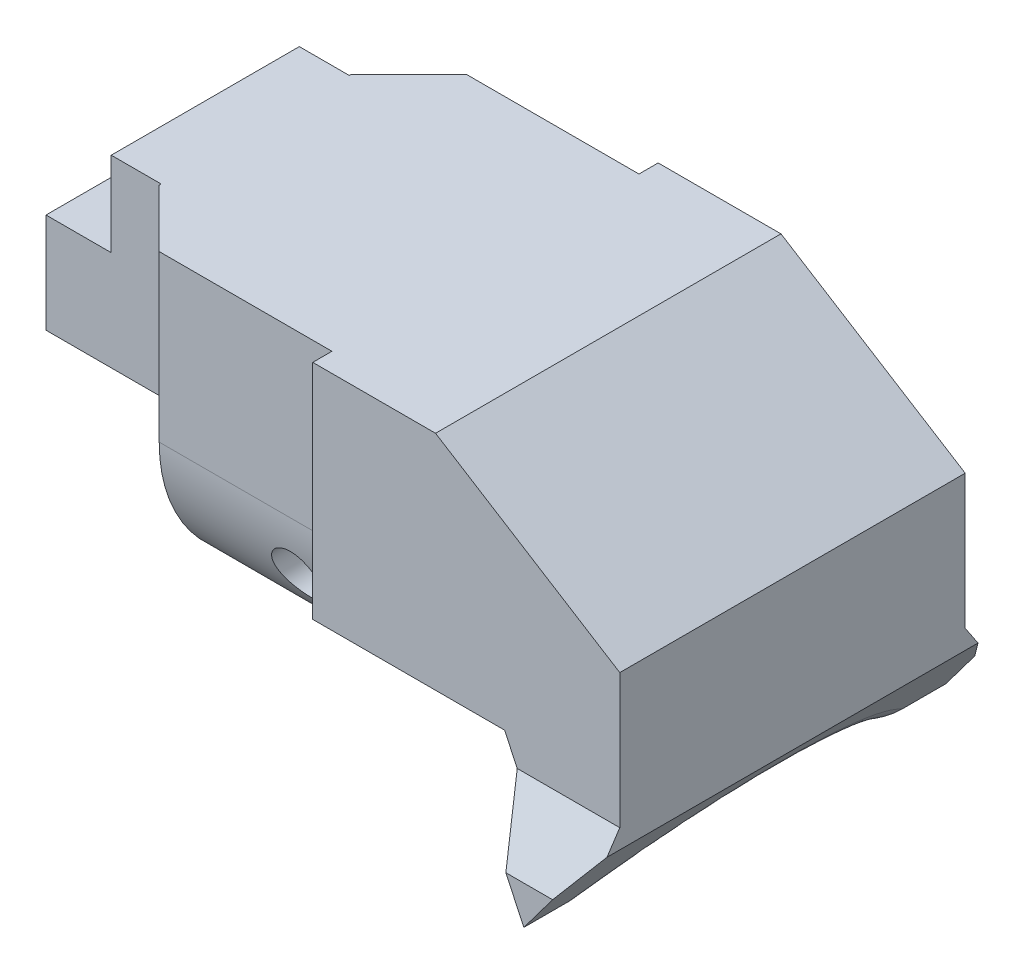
ISO-10303-21;
HEADER;
FILE_DESCRIPTION(('STEP AP214'),'2;1');
FILE_NAME('part.step','',(''),(''),'','','');
FILE_SCHEMA(('AUTOMOTIVE_DESIGN { 1 0 10303 214 1 1 1 1 }'));
ENDSEC;
DATA;
#1=APPLICATION_CONTEXT('core data for automotive mechanical design processes');
#2=APPLICATION_PROTOCOL_DEFINITION('international standard','automotive_design',2000,#1);
#3=PRODUCT_CONTEXT('',#1,'mechanical');
#4=PRODUCT('Part','Part','',(#3));
#5=PRODUCT_RELATED_PRODUCT_CATEGORY('part','',(#4));
#6=PRODUCT_DEFINITION_FORMATION('','',#4);
#7=PRODUCT_DEFINITION_CONTEXT('part definition',#1,'design');
#8=PRODUCT_DEFINITION('design','',#6,#7);
#9=PRODUCT_DEFINITION_SHAPE('','',#8);
#10=(LENGTH_UNIT() NAMED_UNIT(*) SI_UNIT(.MILLI.,.METRE.));
#11=(NAMED_UNIT(*) PLANE_ANGLE_UNIT() SI_UNIT($,.RADIAN.));
#12=(NAMED_UNIT(*) SI_UNIT($,.STERADIAN.) SOLID_ANGLE_UNIT());
#13=UNCERTAINTY_MEASURE_WITH_UNIT(LENGTH_MEASURE(1.E-05),#10,'distance_accuracy_value','');
#14=(GEOMETRIC_REPRESENTATION_CONTEXT(3) GLOBAL_UNCERTAINTY_ASSIGNED_CONTEXT((#13)) GLOBAL_UNIT_ASSIGNED_CONTEXT((#10,
#11,#12)) REPRESENTATION_CONTEXT('',''));
#15=CARTESIAN_POINT('',(0.,0.,0.));
#16=DIRECTION('',(0.,0.,1.));
#17=DIRECTION('',(1.,0.,0.));
#18=AXIS2_PLACEMENT_3D('',#15,#16,#17);
#19=CARTESIAN_POINT('',(3.,0.,-5.5));
#20=DIRECTION('',(-1.,0.,0.));
#21=DIRECTION('',(0.,-1.,0.));
#22=AXIS2_PLACEMENT_3D('',#19,#20,#21);
#23=PLANE('',#22);
#24=DIRECTION('',(0.,0.,1.));
#25=VECTOR('',#24,1.);
#26=CARTESIAN_POINT('',(3.,0.,-5.5));
#27=LINE('',#26,#25);
#28=CARTESIAN_POINT('',(3.,0.,-2.44948974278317));
#29=VERTEX_POINT('',#28);
#30=CARTESIAN_POINT('',(3.,0.,2.44948974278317));
#31=VERTEX_POINT('',#30);
#32=EDGE_CURVE('E541',#29,#31,#27,.T.);
#33=ORIENTED_EDGE('',*,*,#32,.F.);
#34=CARTESIAN_POINT('',(3.,0.500000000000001,0.));
#35=DIRECTION('',(-1.,0.,0.));
#36=DIRECTION('',(0.,-1.,0.));
#37=AXIS2_PLACEMENT_3D('',#34,#35,#36);
#38=CIRCLE('',#37,2.5);
#39=EDGE_CURVE('E474',#29,#31,#38,.T.);
#40=ORIENTED_EDGE('',*,*,#39,.T.);
#41=EDGE_LOOP('',(#33,#40));
#42=FACE_BOUND('',#41,.T.);
#43=ADVANCED_FACE('F38',(#42),#23,.T.);
#44=CARTESIAN_POINT('',(3.,0.500000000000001,0.));
#45=DIRECTION('',(-1.,0.,0.));
#46=DIRECTION('',(0.,-1.,0.));
#47=AXIS2_PLACEMENT_3D('',#44,#45,#46);
#48=CIRCLE('',#47,2.5);
#49=CARTESIAN_POINT('',(3.,0.00250628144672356,2.45));
#50=VERTEX_POINT('',#49);
#51=CARTESIAN_POINT('',(3.,0.500000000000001,2.5));
#52=VERTEX_POINT('',#51);
#53=EDGE_CURVE('E467',#50,#52,#48,.T.);
#54=ORIENTED_EDGE('',*,*,#53,.T.);
#55=DIRECTION('',(0.,1.,0.));
#56=VECTOR('',#55,1.);
#57=CARTESIAN_POINT('',(3.,0.,2.5));
#58=LINE('',#57,#56);
#59=CARTESIAN_POINT('',(3.,4.8,2.5));
#60=VERTEX_POINT('',#59);
#61=EDGE_CURVE('E469',#52,#60,#58,.T.);
#62=ORIENTED_EDGE('',*,*,#61,.T.);
#63=DIRECTION('',(0.,0.,1.));
#64=VECTOR('',#63,1.);
#65=CARTESIAN_POINT('',(3.,4.8,-5.5));
#66=LINE('',#65,#64);
#67=CARTESIAN_POINT('',(3.,4.8,2.45));
#68=VERTEX_POINT('',#67);
#69=EDGE_CURVE('E663',#68,#60,#66,.T.);
#70=ORIENTED_EDGE('',*,*,#69,.F.);
#71=DIRECTION('',(0.,-1.,0.));
#72=VECTOR('',#71,1.);
#73=CARTESIAN_POINT('',(3.,4.79999999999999,2.45));
#74=LINE('',#73,#72);
#75=EDGE_CURVE('E672',#68,#50,#74,.T.);
#76=ORIENTED_EDGE('',*,*,#75,.T.);
#77=EDGE_LOOP('',(#54,#62,#70,#76));
#78=FACE_BOUND('',#77,.T.);
#79=ADVANCED_FACE('F425',(#78),#23,.T.);
#80=CARTESIAN_POINT('',(12.2,4.8,-5.5));
#81=DIRECTION('',(0.,1.,0.));
#82=DIRECTION('',(0.,0.,1.));
#83=AXIS2_PLACEMENT_3D('',#80,#81,#82);
#84=PLANE('',#83);
#85=ORIENTED_EDGE('',*,*,#69,.T.);
#86=DIRECTION('',(-0.707106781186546,0.,-0.707106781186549));
#87=VECTOR('',#86,1.);
#88=CARTESIAN_POINT('',(3.59999999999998,4.8,3.09999999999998));
#89=LINE('',#88,#87);
#90=CARTESIAN_POINT('',(4.5,4.8,4.));
#91=VERTEX_POINT('',#90);
#92=EDGE_CURVE('E478',#60,#91,#89,.F.);
#93=ORIENTED_EDGE('',*,*,#92,.T.);
#94=DIRECTION('',(1.,0.,0.));
#95=VECTOR('',#94,1.);
#96=CARTESIAN_POINT('',(12.2,4.8,4.));
#97=LINE('',#96,#95);
#98=CARTESIAN_POINT('',(9.,4.8,4.));
#99=VERTEX_POINT('',#98);
#100=EDGE_CURVE('E493',#91,#99,#97,.T.);
#101=ORIENTED_EDGE('',*,*,#100,.T.);
#102=DIRECTION('',(0.,0.,1.));
#103=VECTOR('',#102,1.);
#104=CARTESIAN_POINT('',(9.,4.8,-5.5));
#105=LINE('',#104,#103);
#106=CARTESIAN_POINT('',(9.,4.8,4.5));
#107=VERTEX_POINT('',#106);
#108=EDGE_CURVE('E579',#99,#107,#105,.T.);
#109=ORIENTED_EDGE('',*,*,#108,.T.);
#110=DIRECTION('',(1.,0.,0.));
#111=VECTOR('',#110,1.);
#112=CARTESIAN_POINT('',(12.2,4.8,4.5));
#113=LINE('',#112,#111);
#114=CARTESIAN_POINT('',(12.2,4.8,4.5));
#115=VERTEX_POINT('',#114);
#116=EDGE_CURVE('E614',#107,#115,#113,.T.);
#117=ORIENTED_EDGE('',*,*,#116,.T.);
#118=DIRECTION('',(0.,0.,1.));
#119=VECTOR('',#118,1.);
#120=CARTESIAN_POINT('',(12.2,4.8,-5.5));
#121=LINE('',#120,#119);
#122=CARTESIAN_POINT('',(12.2,4.8,-4.5));
#123=VERTEX_POINT('',#122);
#124=EDGE_CURVE('E525',#123,#115,#121,.T.);
#125=ORIENTED_EDGE('',*,*,#124,.F.);
#126=DIRECTION('',(-1.,0.,0.));
#127=VECTOR('',#126,1.);
#128=CARTESIAN_POINT('',(12.2,4.8,-4.5));
#129=LINE('',#128,#127);
#130=CARTESIAN_POINT('',(9.,4.8,-4.5));
#131=VERTEX_POINT('',#130);
#132=EDGE_CURVE('E605',#123,#131,#129,.T.);
#133=ORIENTED_EDGE('',*,*,#132,.T.);
#134=CARTESIAN_POINT('',(9.,4.8,-4.));
#135=VERTEX_POINT('',#134);
#136=EDGE_CURVE('E491',#131,#135,#105,.T.);
#137=ORIENTED_EDGE('',*,*,#136,.T.);
#138=DIRECTION('',(-1.,0.,0.));
#139=VECTOR('',#138,1.);
#140=CARTESIAN_POINT('',(12.2,4.8,-4.));
#141=LINE('',#140,#139);
#142=CARTESIAN_POINT('',(4.5,4.8,-4.));
#143=VERTEX_POINT('',#142);
#144=EDGE_CURVE('E485',#135,#143,#141,.T.);
#145=ORIENTED_EDGE('',*,*,#144,.T.);
#146=DIRECTION('',(0.707106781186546,0.,-0.707106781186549));
#147=VECTOR('',#146,1.);
#148=CARTESIAN_POINT('',(9.09999999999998,4.8,-8.6));
#149=LINE('',#148,#147);
#150=CARTESIAN_POINT('',(3.,4.8,-2.5));
#151=VERTEX_POINT('',#150);
#152=EDGE_CURVE('E476',#143,#151,#149,.F.);
#153=ORIENTED_EDGE('',*,*,#152,.T.);
#154=CARTESIAN_POINT('',(3.,4.8,-2.45));
#155=VERTEX_POINT('',#154);
#156=EDGE_CURVE('E453',#151,#155,#66,.T.);
#157=ORIENTED_EDGE('',*,*,#156,.T.);
#158=DIRECTION('',(-1.,0.,0.));
#159=VECTOR('',#158,1.);
#160=CARTESIAN_POINT('',(18.2011056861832,4.79999999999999,-2.45));
#161=LINE('',#160,#159);
#162=CARTESIAN_POINT('',(1.7,4.8,-2.45));
#163=VERTEX_POINT('',#162);
#164=EDGE_CURVE('E668',#155,#163,#161,.T.);
#165=ORIENTED_EDGE('',*,*,#164,.T.);
#166=DIRECTION('',(0.,0.,1.));
#167=VECTOR('',#166,1.);
#168=CARTESIAN_POINT('',(1.7,4.8,-5.5));
#169=LINE('',#168,#167);
#170=CARTESIAN_POINT('',(1.7,4.8,2.45));
#171=VERTEX_POINT('',#170);
#172=EDGE_CURVE('E522',#163,#171,#169,.T.);
#173=ORIENTED_EDGE('',*,*,#172,.T.);
#174=DIRECTION('',(-1.,0.,0.));
#175=VECTOR('',#174,1.);
#176=CARTESIAN_POINT('',(18.2011056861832,4.79999999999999,2.45));
#177=LINE('',#176,#175);
#178=EDGE_CURVE('E666',#68,#171,#177,.T.);
#179=ORIENTED_EDGE('',*,*,#178,.F.);
#180=EDGE_LOOP('',(#85,#93,#101,#109,#117,#125,#133,#137,#145,#153,#157,#165,#173,#179));
#181=FACE_BOUND('',#180,.T.);
#182=ADVANCED_FACE('F417',(#181),#84,.T.);
#183=CARTESIAN_POINT('',(1.7,2.6,-5.5));
#184=DIRECTION('',(0.,1.,0.));
#185=DIRECTION('',(0.,0.,1.));
#186=AXIS2_PLACEMENT_3D('',#183,#184,#185);
#187=PLANE('',#186);
#188=DIRECTION('',(0.,0.,1.));
#189=VECTOR('',#188,1.);
#190=CARTESIAN_POINT('',(1.7,2.6,-5.5));
#191=LINE('',#190,#189);
#192=CARTESIAN_POINT('',(1.7,2.6,-2.45));
#193=VERTEX_POINT('',#192);
#194=CARTESIAN_POINT('',(1.7,2.6,2.45));
#195=VERTEX_POINT('',#194);
#196=EDGE_CURVE('E518',#193,#195,#191,.T.);
#197=ORIENTED_EDGE('',*,*,#196,.F.);
#198=DIRECTION('',(-1.,0.,0.));
#199=VECTOR('',#198,1.);
#200=CARTESIAN_POINT('',(1.7,2.6,-2.45));
#201=LINE('',#200,#199);
#202=CARTESIAN_POINT('',(0.,2.6,-2.45));
#203=VERTEX_POINT('',#202);
#204=EDGE_CURVE('E646',#193,#203,#201,.T.);
#205=ORIENTED_EDGE('',*,*,#204,.T.);
#206=DIRECTION('',(0.,0.,1.));
#207=VECTOR('',#206,1.);
#208=CARTESIAN_POINT('',(0.,2.6,-5.5));
#209=LINE('',#208,#207);
#210=CARTESIAN_POINT('',(0.,2.6,2.45));
#211=VERTEX_POINT('',#210);
#212=EDGE_CURVE('E517',#203,#211,#209,.T.);
#213=ORIENTED_EDGE('',*,*,#212,.T.);
#214=DIRECTION('',(1.,0.,0.));
#215=VECTOR('',#214,1.);
#216=CARTESIAN_POINT('',(1.7,2.6,2.45));
#217=LINE('',#216,#215);
#218=EDGE_CURVE('E654',#211,#195,#217,.T.);
#219=ORIENTED_EDGE('',*,*,#218,.T.);
#220=EDGE_LOOP('',(#197,#205,#213,#219));
#221=FACE_BOUND('',#220,.T.);
#222=ADVANCED_FACE('F415',(#221),#187,.T.);
#223=CARTESIAN_POINT('',(1.7,4.8,-5.5));
#224=DIRECTION('',(-1.,0.,0.));
#225=DIRECTION('',(0.,-1.,0.));
#226=AXIS2_PLACEMENT_3D('',#223,#224,#225);
#227=PLANE('',#226);
#228=ORIENTED_EDGE('',*,*,#172,.F.);
#229=DIRECTION('',(0.,-1.,0.));
#230=VECTOR('',#229,1.);
#231=CARTESIAN_POINT('',(1.7,4.8,-2.45));
#232=LINE('',#231,#230);
#233=EDGE_CURVE('E649',#163,#193,#232,.T.);
#234=ORIENTED_EDGE('',*,*,#233,.T.);
#235=ORIENTED_EDGE('',*,*,#196,.T.);
#236=DIRECTION('',(0.,1.,0.));
#237=VECTOR('',#236,1.);
#238=CARTESIAN_POINT('',(1.7,4.8,2.45));
#239=LINE('',#238,#237);
#240=EDGE_CURVE('E657',#195,#171,#239,.T.);
#241=ORIENTED_EDGE('',*,*,#240,.T.);
#242=EDGE_LOOP('',(#228,#234,#235,#241));
#243=FACE_BOUND('',#242,.T.);
#244=ADVANCED_FACE('F409',(#243),#227,.T.);
#245=CARTESIAN_POINT('',(0.,0.,-5.5));
#246=DIRECTION('',(0.,-1.,0.));
#247=DIRECTION('',(0.,0.,-1.));
#248=AXIS2_PLACEMENT_3D('',#245,#246,#247);
#249=PLANE('',#248);
#250=DIRECTION('',(0.,0.,1.));
#251=VECTOR('',#250,1.);
#252=CARTESIAN_POINT('',(0.,0.,-5.5));
#253=LINE('',#252,#251);
#254=CARTESIAN_POINT('',(0.,0.,-2.45));
#255=VERTEX_POINT('',#254);
#256=CARTESIAN_POINT('',(0.,0.,2.45));
#257=VERTEX_POINT('',#256);
#258=EDGE_CURVE('E544',#255,#257,#253,.T.);
#259=ORIENTED_EDGE('',*,*,#258,.F.);
#260=DIRECTION('',(1.,0.,0.));
#261=VECTOR('',#260,1.);
#262=CARTESIAN_POINT('',(0.,0.,-2.45));
#263=LINE('',#262,#261);
#264=CARTESIAN_POINT('',(3.00049995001,0.,-2.45));
#265=VERTEX_POINT('',#264);
#266=EDGE_CURVE('E652',#255,#265,#263,.T.);
#267=ORIENTED_EDGE('',*,*,#266,.T.);
#268=CARTESIAN_POINT('',(3.00049995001,0.,-2.45));
#269=CARTESIAN_POINT('',(3.00041662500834,0.,-2.44991495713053));
#270=CARTESIAN_POINT('',(3.00033330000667,0.,-2.44982991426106));
#271=CARTESIAN_POINT('',(3.00016665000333,0.,-2.44965982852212));
#272=CARTESIAN_POINT('',(3.00008332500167,0.,-2.44957478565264));
#273=CARTESIAN_POINT('',(3.,0.,-2.44948974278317));
#274=B_SPLINE_CURVE_WITH_KNOTS('',3,(#268,#269,#270,#271,#272,#273),.UNSPECIFIED.,.F.,.F.,(4,2,
4),(0.,0.000357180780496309,0.000714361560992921),.UNSPECIFIED.);
#275=EDGE_CURVE('E376',#265,#29,#274,.T.);
#276=ORIENTED_EDGE('',*,*,#275,.T.);
#277=ORIENTED_EDGE('',*,*,#32,.T.);
#278=CARTESIAN_POINT('',(3.,0.,2.44948974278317));
#279=CARTESIAN_POINT('',(3.00008332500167,0.,2.44957478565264));
#280=CARTESIAN_POINT('',(3.00016665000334,0.,2.44965982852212));
#281=CARTESIAN_POINT('',(3.00033330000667,0.,2.44982991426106));
#282=CARTESIAN_POINT('',(3.00041662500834,0.,2.44991495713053));
#283=CARTESIAN_POINT('',(3.00049995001,0.,2.45));
#284=B_SPLINE_CURVE_WITH_KNOTS('',3,(#278,#279,#280,#281,#282,#283),.UNSPECIFIED.,.F.,.F.,(4,2,
4),(0.,0.000357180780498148,0.000714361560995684),.UNSPECIFIED.);
#285=CARTESIAN_POINT('',(3.00049995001,0.,2.45));
#286=VERTEX_POINT('',#285);
#287=EDGE_CURVE('E394',#31,#286,#284,.T.);
#288=ORIENTED_EDGE('',*,*,#287,.T.);
#289=DIRECTION('',(-1.,0.,0.));
#290=VECTOR('',#289,1.);
#291=CARTESIAN_POINT('',(0.,0.,2.45));
#292=LINE('',#291,#290);
#293=EDGE_CURVE('E660',#286,#257,#292,.T.);
#294=ORIENTED_EDGE('',*,*,#293,.T.);
#295=EDGE_LOOP('',(#259,#267,#276,#277,#288,#294));
#296=FACE_BOUND('',#295,.T.);
#297=ADVANCED_FACE('F404',(#296),#249,.T.);
#298=CARTESIAN_POINT('',(0.,2.6,-5.5));
#299=DIRECTION('',(-1.,0.,0.));
#300=DIRECTION('',(0.,-1.,0.));
#301=AXIS2_PLACEMENT_3D('',#298,#299,#300);
#302=PLANE('',#301);
#303=ORIENTED_EDGE('',*,*,#212,.F.);
#304=DIRECTION('',(0.,-1.,0.));
#305=VECTOR('',#304,1.);
#306=CARTESIAN_POINT('',(0.,4.8,-2.45));
#307=LINE('',#306,#305);
#308=EDGE_CURVE('E669',#203,#255,#307,.T.);
#309=ORIENTED_EDGE('',*,*,#308,.T.);
#310=ORIENTED_EDGE('',*,*,#258,.T.);
#311=DIRECTION('',(0.,1.,0.));
#312=VECTOR('',#311,1.);
#313=CARTESIAN_POINT('',(0.,4.8,2.45));
#314=LINE('',#313,#312);
#315=EDGE_CURVE('E462',#257,#211,#314,.T.);
#316=ORIENTED_EDGE('',*,*,#315,.T.);
#317=EDGE_LOOP('',(#303,#309,#310,#316));
#318=FACE_BOUND('',#317,.T.);
#319=ADVANCED_FACE('F338',(#318),#302,.T.);
#320=CARTESIAN_POINT('',(9.,0.499999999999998,0.));
#321=DIRECTION('',(-1.,0.,0.));
#322=DIRECTION('',(0.,-1.,0.));
#323=AXIS2_PLACEMENT_3D('',#320,#321,#322);
#324=CYLINDRICAL_SURFACE('',#323,4.);
#325=CARTESIAN_POINT('',(8.478125,-0.999999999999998,-3.70809924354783));
#326=CARTESIAN_POINT('',(8.47812380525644,-1.0400607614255,-3.69189289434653));
#327=CARTESIAN_POINT('',(8.47441374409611,-1.07987568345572,-3.67502445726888));
#328=CARTESIAN_POINT('',(8.45991161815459,-1.15787077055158,-3.64050682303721));
#329=CARTESIAN_POINT('',(8.44911122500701,-1.19604895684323,-3.62285673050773));
#330=CARTESIAN_POINT('',(8.42083503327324,-1.26972072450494,-3.58744427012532));
#331=CARTESIAN_POINT('',(8.40336843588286,-1.30521792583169,-3.56968209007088));
#332=CARTESIAN_POINT('',(8.36213281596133,-1.37269184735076,-3.53475171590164));
#333=CARTESIAN_POINT('',(8.33836252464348,-1.40466785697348,-3.51758364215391));
#334=CARTESIAN_POINT('',(8.28476366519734,-1.46432609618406,-3.48462214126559));
#335=CARTESIAN_POINT('',(8.25490139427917,-1.49198285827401,-3.46883709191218));
#336=CARTESIAN_POINT('',(8.18974716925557,-1.5416649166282,-3.43983033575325));
#337=CARTESIAN_POINT('',(8.15446386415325,-1.56369903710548,-3.42660462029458));
#338=CARTESIAN_POINT('',(8.08850948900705,-1.59641231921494,-3.40665963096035));
#339=CARTESIAN_POINT('',(8.05879946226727,-1.60854955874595,-3.39914026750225));
#340=CARTESIAN_POINT('',(7.99741267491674,-1.62839437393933,-3.38674995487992));
#341=CARTESIAN_POINT('',(7.96573753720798,-1.63610555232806,-3.38187685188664));
#342=CARTESIAN_POINT('',(7.90114842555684,-1.64671653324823,-3.37515171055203));
#343=CARTESIAN_POINT('',(7.86823034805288,-1.64959865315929,-3.37331077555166));
#344=CARTESIAN_POINT('',(7.80231472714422,-1.65032274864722,-3.372849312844));
#345=CARTESIAN_POINT('',(7.76931718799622,-1.64816498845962,-3.37422861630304));
#346=CARTESIAN_POINT('',(7.7062827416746,-1.63922358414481,-3.37990341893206));
#347=CARTESIAN_POINT('',(7.67618750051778,-1.63272772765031,-3.38401742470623));
#348=CARTESIAN_POINT('',(7.61761292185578,-1.61572343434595,-3.39467439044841));
#349=CARTESIAN_POINT('',(7.58913386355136,-1.60521430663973,-3.4012177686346));
#350=CARTESIAN_POINT('',(7.53288743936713,-1.57994489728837,-3.41673228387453));
#351=CARTESIAN_POINT('',(7.50524051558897,-1.56498655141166,-3.42581496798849));
#352=CARTESIAN_POINT('',(7.45281526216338,-1.53161037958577,-3.44571277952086));
#353=CARTESIAN_POINT('',(7.42803821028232,-1.51319102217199,-3.45652867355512));
#354=CARTESIAN_POINT('',(7.37849599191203,-1.47067900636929,-3.4809628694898));
#355=CARTESIAN_POINT('',(7.35418992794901,-1.44615554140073,-3.49476226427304));
#356=CARTESIAN_POINT('',(7.30996273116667,-1.39392949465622,-3.52333911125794));
#357=CARTESIAN_POINT('',(7.29004415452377,-1.36622507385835,-3.53811712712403));
#358=CARTESIAN_POINT('',(7.25258766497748,-1.30450083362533,-3.57003228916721));
#359=CARTESIAN_POINT('',(7.23568164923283,-1.27012663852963,-3.58722912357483));
#360=CARTESIAN_POINT('',(7.20812413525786,-1.19889257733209,-3.62150902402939));
#361=CARTESIAN_POINT('',(7.19747491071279,-1.16203181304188,-3.6385920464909));
#362=CARTESIAN_POINT('',(7.18245319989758,-1.08496102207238,-3.67284015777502));
#363=CARTESIAN_POINT('',(7.17839218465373,-1.04467492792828,-3.68997283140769));
#364=CARTESIAN_POINT('',(7.1778835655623,-0.963507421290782,-3.72291047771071));
#365=CARTESIAN_POINT('',(7.18143420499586,-0.922626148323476,-3.73871575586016));
#366=CARTESIAN_POINT('',(7.19604962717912,-0.843364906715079,-3.76790110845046));
#367=CARTESIAN_POINT('',(7.20678748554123,-0.804952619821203,-3.78135586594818));
#368=CARTESIAN_POINT('',(7.23540761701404,-0.730213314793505,-3.80632715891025));
#369=CARTESIAN_POINT('',(7.25328642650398,-0.693885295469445,-3.81784463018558));
#370=CARTESIAN_POINT('',(7.29426164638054,-0.627300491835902,-3.83800953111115));
#371=CARTESIAN_POINT('',(7.31687956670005,-0.59679387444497,-3.84680544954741));
#372=CARTESIAN_POINT('',(7.36737481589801,-0.539942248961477,-3.86256279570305));
#373=CARTESIAN_POINT('',(7.39525051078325,-0.513595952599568,-3.86952479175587));
#374=CARTESIAN_POINT('',(7.45387469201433,-0.467309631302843,-3.88134705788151));
#375=CARTESIAN_POINT('',(7.48439877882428,-0.447107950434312,-3.88629770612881));
#376=CARTESIAN_POINT('',(7.5485671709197,-0.412051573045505,-3.89467433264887));
#377=CARTESIAN_POINT('',(7.58221103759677,-0.397196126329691,-3.89810052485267));
#378=CARTESIAN_POINT('',(7.65084448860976,-0.373614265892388,-3.90345256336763));
#379=CARTESIAN_POINT('',(7.68578706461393,-0.364758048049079,-3.90541029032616));
#380=CARTESIAN_POINT('',(7.75670244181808,-0.352936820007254,-3.90800921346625));
#381=CARTESIAN_POINT('',(7.79267519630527,-0.349971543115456,-3.90865046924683));
#382=CARTESIAN_POINT('',(7.86438495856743,-0.350028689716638,-3.90863801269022));
#383=CARTESIAN_POINT('',(7.90012200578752,-0.353013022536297,-3.90799253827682));
#384=CARTESIAN_POINT('',(7.97057499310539,-0.364796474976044,-3.90540176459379));
#385=CARTESIAN_POINT('',(8.00529095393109,-0.373595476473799,-3.90345649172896));
#386=CARTESIAN_POINT('',(8.07271408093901,-0.396720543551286,-3.89820879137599));
#387=CARTESIAN_POINT('',(8.10542159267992,-0.411045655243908,-3.89490659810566));
#388=CARTESIAN_POINT('',(8.16792120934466,-0.444753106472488,-3.88686768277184));
#389=CARTESIAN_POINT('',(8.19771340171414,-0.464135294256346,-3.88213100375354));
#390=CARTESIAN_POINT('',(8.25373385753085,-0.507438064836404,-3.87111982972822));
#391=CARTESIAN_POINT('',(8.27994179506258,-0.531382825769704,-3.86483708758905));
#392=CARTESIAN_POINT('',(8.32793932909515,-0.582954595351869,-3.85070419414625));
#393=CARTESIAN_POINT('',(8.34972827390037,-0.610582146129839,-3.84285381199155));
#394=CARTESIAN_POINT('',(8.38877771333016,-0.669193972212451,-3.82543290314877));
#395=CARTESIAN_POINT('',(8.40594275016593,-0.700232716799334,-3.81583211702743));
#396=CARTESIAN_POINT('',(8.43487710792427,-0.764235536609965,-3.79510713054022));
#397=CARTESIAN_POINT('',(8.44664828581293,-0.797198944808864,-3.78398345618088));
#398=CARTESIAN_POINT('',(8.46319762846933,-0.858518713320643,-3.76235327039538));
#399=CARTESIAN_POINT('',(8.46881483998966,-0.886726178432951,-3.75205341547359));
#400=CARTESIAN_POINT('',(8.4762792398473,-0.943329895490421,-3.73064547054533));
#401=CARTESIAN_POINT('',(8.47812584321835,-0.971726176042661,-3.71953725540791));
#402=CARTESIAN_POINT('',(8.478125,-0.999999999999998,-3.70809924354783));
#403=B_SPLINE_CURVE_WITH_KNOTS('',3,(#325,#326,#327,#328,#329,#330,#331,#332,#333,#334,#335,
#336,#337,#338,#339,#340,#341,#342,#343,#344,#345,#346,#347,#348,#349,#350,#351,#352,#353,#354,
#355,#356,#357,#358,#359,#360,#361,#362,#363,#364,#365,#366,#367,#368,#369,#370,#371,#372,#373,
#374,#375,#376,#377,#378,#379,#380,#381,#382,#383,#384,#385,#386,#387,#388,#389,#390,#391,#392,
#393,#394,#395,#396,#397,#398,#399,#400,#401,#402),.UNSPECIFIED.,.T.,.F.,(4,2,2,2,2,2,2,2,2,2,2,
2,2,2,2,2,2,2,2,2,2,2,2,2,2,2,2,2,2,2,2,2,2,2,2,2,2,2,4),(0.,0.12952961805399,0.259211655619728,
0.388715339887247,0.518245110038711,0.648511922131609,0.778573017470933,0.877046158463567,
0.975439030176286,1.07419140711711,1.17293860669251,1.26571112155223,1.35849961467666,
1.45627329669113,1.55409034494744,1.66519905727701,1.77637233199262,1.90178806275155,
2.02724934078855,2.15848542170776,2.2896912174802,2.4153012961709,2.54085052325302,
2.65719732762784,2.77350803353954,2.88377786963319,2.99403222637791,3.10181753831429,
3.20959797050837,3.31669058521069,3.42378102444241,3.53085298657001,3.63792173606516,
3.74557449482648,3.85324311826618,3.96298859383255,4.07269625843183,4.16410065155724,
4.25551922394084),.UNSPECIFIED.);
#404=CARTESIAN_POINT('',(8.10400701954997,-1.58854830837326,-3.41144631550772));
#405=VERTEX_POINT('',#404);
#406=CARTESIAN_POINT('',(8.478125,-0.999999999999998,-3.70809924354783));
#407=VERTEX_POINT('',#406);
#408=EDGE_CURVE('E350',#405,#407,#403,.T.);
#409=ORIENTED_EDGE('',*,*,#408,.F.);
#410=CARTESIAN_POINT('',(7.125,0.499999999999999,0.));
#411=DIRECTION('',(0.905458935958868,0.42443387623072,0.));
#412=DIRECTION('',(-0.42443387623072,0.905458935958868,0.));
#413=AXIS2_PLACEMENT_3D('',#410,#411,#412);
#414=ELLIPSE('',#413,4.41764926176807,4.);
#415=CARTESIAN_POINT('',(9.,-3.5,0.));
#416=VERTEX_POINT('',#415);
#417=EDGE_CURVE('E492',#416,#405,#414,.T.);
#418=ORIENTED_EDGE('',*,*,#417,.F.);
#419=CARTESIAN_POINT('',(8.10400701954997,-1.58854830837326,3.41144631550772));
#420=VERTEX_POINT('',#419);
#421=EDGE_CURVE('E496',#420,#416,#414,.T.);
#422=ORIENTED_EDGE('',*,*,#421,.F.);
#423=CARTESIAN_POINT('',(8.478125,-0.999999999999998,3.70809924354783));
#424=CARTESIAN_POINT('',(8.47812406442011,-0.963214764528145,3.72297911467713));
#425=CARTESIAN_POINT('',(8.47499654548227,-0.926192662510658,3.73731305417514));
#426=CARTESIAN_POINT('',(8.46231212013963,-0.852699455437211,3.76453729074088));
#427=CARTESIAN_POINT('',(8.45275315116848,-0.816228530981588,3.77742712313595));
#428=CARTESIAN_POINT('',(8.42717799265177,-0.744904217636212,3.80153052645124));
#429=CARTESIAN_POINT('',(8.41114509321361,-0.710055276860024,3.81273965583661));
#430=CARTESIAN_POINT('',(8.3728845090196,-0.643328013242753,3.83327807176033));
#431=CARTESIAN_POINT('',(8.35065862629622,-0.611448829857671,3.84260790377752));
#432=CARTESIAN_POINT('',(8.30183670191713,-0.553387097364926,3.85891711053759));
#433=CARTESIAN_POINT('',(8.2755172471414,-0.526998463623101,3.86599122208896));
#434=CARTESIAN_POINT('',(8.21851360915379,-0.478957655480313,3.87843516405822));
#435=CARTESIAN_POINT('',(8.1878302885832,-0.457304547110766,3.88380533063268));
#436=CARTESIAN_POINT('',(8.12424951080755,-0.420247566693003,3.8927490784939));
#437=CARTESIAN_POINT('',(8.09148060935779,-0.404637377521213,3.89638320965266));
#438=CARTESIAN_POINT('',(8.02369135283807,-0.379060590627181,3.90223343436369));
#439=CARTESIAN_POINT('',(7.98867121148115,-0.369093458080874,3.90444966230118));
#440=CARTESIAN_POINT('',(7.91790360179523,-0.355235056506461,3.907508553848));
#441=CARTESIAN_POINT('',(7.88217321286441,-0.351260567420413,3.90837003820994));
#442=CARTESIAN_POINT('',(7.81053821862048,-0.349250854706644,3.90880725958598));
#443=CARTESIAN_POINT('',(7.77463361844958,-0.351215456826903,3.90838303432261));
#444=CARTESIAN_POINT('',(7.70378870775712,-0.361004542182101,3.90623804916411));
#445=CARTESIAN_POINT('',(7.66884570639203,-0.36881047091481,3.90452139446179));
#446=CARTESIAN_POINT('',(7.60079511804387,-0.39000729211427,3.89974411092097));
#447=CARTESIAN_POINT('',(7.56768749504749,-0.403398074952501,3.89668350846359));
#448=CARTESIAN_POINT('',(7.50417806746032,-0.435354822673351,3.88913615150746));
#449=CARTESIAN_POINT('',(7.47378101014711,-0.453929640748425,3.88464695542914));
#450=CARTESIAN_POINT('',(7.41658497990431,-0.49563155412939,3.87416810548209));
#451=CARTESIAN_POINT('',(7.38978600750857,-0.518758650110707,3.86817845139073));
#452=CARTESIAN_POINT('',(7.3402288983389,-0.569052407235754,3.85458303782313));
#453=CARTESIAN_POINT('',(7.31751273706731,-0.59625627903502,3.84696208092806));
#454=CARTESIAN_POINT('',(7.27696705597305,-0.653647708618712,3.83014232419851));
#455=CARTESIAN_POINT('',(7.25913797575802,-0.683835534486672,3.82094338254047));
#456=CARTESIAN_POINT('',(7.2282590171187,-0.747144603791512,3.80075828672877));
#457=CARTESIAN_POINT('',(7.21535785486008,-0.780324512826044,3.78972910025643));
#458=CARTESIAN_POINT('',(7.19519698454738,-0.847864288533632,3.76623699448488));
#459=CARTESIAN_POINT('',(7.18793860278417,-0.882224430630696,3.75377373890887));
#460=CARTESIAN_POINT('',(7.17878151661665,-0.953105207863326,3.72692875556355));
#461=CARTESIAN_POINT('',(7.17719912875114,-0.9896408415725,3.71247925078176));
#462=CARTESIAN_POINT('',(7.18007943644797,-1.06206227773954,3.682593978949));
#463=CARTESIAN_POINT('',(7.1845441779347,-1.09794785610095,3.66715787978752));
#464=CARTESIAN_POINT('',(7.19977365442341,-1.17074340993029,3.63459976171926));
#465=CARTESIAN_POINT('',(7.21096170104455,-1.20754628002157,3.61743572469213));
#466=CARTESIAN_POINT('',(7.23961043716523,-1.27860276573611,3.58303404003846));
#467=CARTESIAN_POINT('',(7.25707395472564,-1.31285522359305,3.56579636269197));
#468=CARTESIAN_POINT('',(7.29880363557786,-1.37937542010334,3.53120548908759));
#469=CARTESIAN_POINT('',(7.32332916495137,-1.41149527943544,3.51387897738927));
#470=CARTESIAN_POINT('',(7.37842095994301,-1.47107482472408,3.48080824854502));
#471=CARTESIAN_POINT('',(7.40898745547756,-1.49853433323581,3.46506409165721));
#472=CARTESIAN_POINT('',(7.47394057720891,-1.54644288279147,3.43697626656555));
#473=CARTESIAN_POINT('',(7.50806212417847,-1.56717233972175,3.42450255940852));
#474=CARTESIAN_POINT('',(7.58041833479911,-1.60228812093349,3.40305919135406));
#475=CARTESIAN_POINT('',(7.61864611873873,-1.61668485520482,3.39408378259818));
#476=CARTESIAN_POINT('',(7.69206094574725,-1.63656514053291,3.38159829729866));
#477=CARTESIAN_POINT('',(7.72687527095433,-1.64304417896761,3.37748097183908));
#478=CARTESIAN_POINT('',(7.79732385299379,-1.65023172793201,3.37291027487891));
#479=CARTESIAN_POINT('',(7.83295740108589,-1.65094505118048,3.37245384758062));
#480=CARTESIAN_POINT('',(7.89951311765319,-1.64682507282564,3.37507701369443));
#481=CARTESIAN_POINT('',(7.93049474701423,-1.6426368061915,3.37774541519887));
#482=CARTESIAN_POINT('',(7.99120624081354,-1.62997302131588,3.38574519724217));
#483=CARTESIAN_POINT('',(8.02093601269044,-1.62149718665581,3.39107677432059));
#484=CARTESIAN_POINT('',(8.07896099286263,-1.60045930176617,3.40414827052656));
#485=CARTESIAN_POINT('',(8.10722117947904,-1.58782710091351,3.4119294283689));
#486=CARTESIAN_POINT('',(8.16121586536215,-1.55900637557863,3.42939881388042));
#487=CARTESIAN_POINT('',(8.18694949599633,-1.54281663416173,3.43908769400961));
#488=CARTESIAN_POINT('',(8.23852266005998,-1.50518661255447,3.46117865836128));
#489=CARTESIAN_POINT('',(8.26398960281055,-1.48334621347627,3.47376768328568));
#490=CARTESIAN_POINT('',(8.31099092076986,-1.43640061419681,3.50015408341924));
#491=CARTESIAN_POINT('',(8.33252241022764,-1.41129304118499,3.51395233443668));
#492=CARTESIAN_POINT('',(8.3741140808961,-1.35467631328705,3.54419839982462));
#493=CARTESIAN_POINT('',(8.39355139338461,-1.32276262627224,3.56074753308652));
#494=CARTESIAN_POINT('',(8.42666413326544,-1.25618836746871,3.59404874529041));
#495=CARTESIAN_POINT('',(8.44034120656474,-1.22152858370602,3.61080076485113));
#496=CARTESIAN_POINT('',(8.45990961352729,-1.15595991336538,3.64127552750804));
#497=CARTESIAN_POINT('',(8.46669805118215,-1.12534145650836,3.65505305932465));
#498=CARTESIAN_POINT('',(8.475805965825,-1.06320722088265,3.68205518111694));
#499=CARTESIAN_POINT('',(8.47812580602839,-1.03169151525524,3.69527981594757));
#500=CARTESIAN_POINT('',(8.478125,-0.999999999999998,3.70809924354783));
#501=B_SPLINE_CURVE_WITH_KNOTS('',3,(#423,#424,#425,#426,#427,#428,#429,#430,#431,#432,#433,
#434,#435,#436,#437,#438,#439,#440,#441,#442,#443,#444,#445,#446,#447,#448,#449,#450,#451,#452,
#453,#454,#455,#456,#457,#458,#459,#460,#461,#462,#463,#464,#465,#466,#467,#468,#469,#470,#471,
#472,#473,#474,#475,#476,#477,#478,#479,#480,#481,#482,#483,#484,#485,#486,#487,#488,#489,#490,
#491,#492,#493,#494,#495,#496,#497,#498,#499,#500),.UNSPECIFIED.,.T.,.F.,(4,2,2,2,2,2,2,2,2,2,2,
2,2,2,2,2,2,2,2,2,2,2,2,2,2,2,2,2,2,2,2,2,2,2,2,2,2,2,4),(0.,0.118930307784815,0.23789877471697,
0.357176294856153,0.476419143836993,0.589654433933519,0.70286737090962,0.811775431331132,
0.920673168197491,1.02804424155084,1.13541216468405,1.24244048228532,1.34946669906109,
1.45667682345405,1.5638869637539,1.67214310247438,1.78040897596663,1.89172353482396,
2.00306424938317,2.12052106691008,2.2380176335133,2.36382574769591,2.4896906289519,
2.62094734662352,2.75220906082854,2.87695249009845,3.00149008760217,3.10781758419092,
3.21405631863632,3.30774968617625,3.40144996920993,3.49682062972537,3.59222396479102,
3.69930494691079,3.80646413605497,3.92855214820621,4.05060525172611,4.15307538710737,
4.255537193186),.UNSPECIFIED.);
#502=CARTESIAN_POINT('',(8.478125,-0.999999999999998,3.70809924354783));
#503=VERTEX_POINT('',#502);
#504=EDGE_CURVE('E344',#503,#420,#501,.T.);
#505=ORIENTED_EDGE('',*,*,#504,.F.);
#506=DIRECTION('',(-1.,0.,0.));
#507=VECTOR('',#506,1.);
#508=CARTESIAN_POINT('',(9.,-0.999999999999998,3.70809924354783));
#509=LINE('',#508,#507);
#510=CARTESIAN_POINT('',(9.,-0.999999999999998,3.70809924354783));
#511=VERTEX_POINT('',#510);
#512=EDGE_CURVE('E503',#511,#503,#509,.T.);
#513=ORIENTED_EDGE('',*,*,#512,.F.);
#514=CARTESIAN_POINT('',(9.,0.499999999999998,0.));
#515=DIRECTION('',(-1.,0.,0.));
#516=DIRECTION('',(0.,-1.,0.));
#517=AXIS2_PLACEMENT_3D('',#514,#515,#516);
#518=CIRCLE('',#517,4.);
#519=CARTESIAN_POINT('',(9.,0.499999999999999,4.));
#520=VERTEX_POINT('',#519);
#521=EDGE_CURVE('E571',#511,#520,#518,.T.);
#522=ORIENTED_EDGE('',*,*,#521,.T.);
#523=DIRECTION('',(-1.,0.,0.));
#524=VECTOR('',#523,1.);
#525=CARTESIAN_POINT('',(9.,0.499999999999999,4.));
#526=LINE('',#525,#524);
#527=CARTESIAN_POINT('',(4.5,0.500000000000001,4.));
#528=VERTEX_POINT('',#527);
#529=EDGE_CURVE('E564',#520,#528,#526,.T.);
#530=ORIENTED_EDGE('',*,*,#529,.T.);
#531=CARTESIAN_POINT('',(4.5,0.5,0.));
#532=DIRECTION('',(-1.,0.,0.));
#533=DIRECTION('',(0.,-1.,0.));
#534=AXIS2_PLACEMENT_3D('',#531,#532,#533);
#535=CIRCLE('',#534,4.);
#536=CARTESIAN_POINT('',(4.5,0.5,-4.));
#537=VERTEX_POINT('',#536);
#538=EDGE_CURVE('E479',#528,#537,#535,.F.);
#539=ORIENTED_EDGE('',*,*,#538,.T.);
#540=DIRECTION('',(-1.,0.,0.));
#541=VECTOR('',#540,1.);
#542=CARTESIAN_POINT('',(9.,0.499999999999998,-4.));
#543=LINE('',#542,#541);
#544=CARTESIAN_POINT('',(9.,0.499999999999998,-4.));
#545=VERTEX_POINT('',#544);
#546=EDGE_CURVE('E487',#545,#537,#543,.T.);
#547=ORIENTED_EDGE('',*,*,#546,.F.);
#548=CARTESIAN_POINT('',(9.,-0.999999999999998,-3.70809924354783));
#549=VERTEX_POINT('',#548);
#550=EDGE_CURVE('E595',#545,#549,#518,.T.);
#551=ORIENTED_EDGE('',*,*,#550,.T.);
#552=DIRECTION('',(-1.,0.,0.));
#553=VECTOR('',#552,1.);
#554=CARTESIAN_POINT('',(9.,-0.999999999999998,-3.70809924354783));
#555=LINE('',#554,#553);
#556=EDGE_CURVE('E501',#407,#549,#555,.F.);
#557=ORIENTED_EDGE('',*,*,#556,.F.);
#558=EDGE_LOOP('',(#409,#418,#422,#505,#513,#522,#530,#539,#547,#551,#557));
#559=FACE_BOUND('',#558,.T.);
#560=ADVANCED_FACE('F329',(#559),#324,.T.);
#561=CARTESIAN_POINT('',(9.,0.499999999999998,-4.));
#562=DIRECTION('',(0.,0.,-1.));
#563=DIRECTION('',(-1.,0.,0.));
#564=AXIS2_PLACEMENT_3D('',#561,#562,#563);
#565=PLANE('',#564);
#566=ORIENTED_EDGE('',*,*,#546,.T.);
#567=DIRECTION('',(0.,1.,0.));
#568=VECTOR('',#567,1.);
#569=CARTESIAN_POINT('',(4.5,0.499999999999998,-4.));
#570=LINE('',#569,#568);
#571=EDGE_CURVE('E377',#537,#143,#570,.T.);
#572=ORIENTED_EDGE('',*,*,#571,.T.);
#573=ORIENTED_EDGE('',*,*,#144,.F.);
#574=DIRECTION('',(0.,-1.,0.));
#575=VECTOR('',#574,1.);
#576=CARTESIAN_POINT('',(9.,0.499999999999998,-4.));
#577=LINE('',#576,#575);
#578=EDGE_CURVE('E572',#135,#545,#577,.T.);
#579=ORIENTED_EDGE('',*,*,#578,.T.);
#580=EDGE_LOOP('',(#566,#572,#573,#579));
#581=FACE_BOUND('',#580,.T.);
#582=ADVANCED_FACE('F325',(#581),#565,.T.);
#583=CARTESIAN_POINT('',(9.,7.5,4.));
#584=DIRECTION('',(0.,0.,1.));
#585=DIRECTION('',(0.,-1.,0.));
#586=AXIS2_PLACEMENT_3D('',#583,#584,#585);
#587=PLANE('',#586);
#588=ORIENTED_EDGE('',*,*,#100,.F.);
#589=DIRECTION('',(0.,-1.,0.));
#590=VECTOR('',#589,1.);
#591=CARTESIAN_POINT('',(4.5,7.5,4.));
#592=LINE('',#591,#590);
#593=EDGE_CURVE('E456',#91,#528,#592,.T.);
#594=ORIENTED_EDGE('',*,*,#593,.T.);
#595=ORIENTED_EDGE('',*,*,#529,.F.);
#596=DIRECTION('',(0.,1.,0.));
#597=VECTOR('',#596,1.);
#598=CARTESIAN_POINT('',(9.,7.5,4.));
#599=LINE('',#598,#597);
#600=EDGE_CURVE('E576',#520,#99,#599,.T.);
#601=ORIENTED_EDGE('',*,*,#600,.T.);
#602=EDGE_LOOP('',(#588,#594,#595,#601));
#603=FACE_BOUND('',#602,.T.);
#604=ADVANCED_FACE('F328',(#603),#587,.T.);
#605=CARTESIAN_POINT('',(7.828125,-0.999999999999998,-5.5));
#606=DIRECTION('',(0.,-1.,0.));
#607=DIRECTION('',(0.,0.,-1.));
#608=AXIS2_PLACEMENT_3D('',#605,#606,#607);
#609=PLANE('',#608);
#610=DIRECTION('',(0.,0.,1.));
#611=VECTOR('',#610,1.);
#612=CARTESIAN_POINT('',(8.478125,-0.999999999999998,-5.5));
#613=LINE('',#612,#611);
#614=EDGE_CURVE('E354',#407,#503,#613,.T.);
#615=ORIENTED_EDGE('',*,*,#614,.F.);
#616=ORIENTED_EDGE('',*,*,#556,.T.);
#617=DIRECTION('',(0.,0.,-1.));
#618=VECTOR('',#617,1.);
#619=CARTESIAN_POINT('',(9.,-0.999999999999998,-5.5));
#620=LINE('',#619,#618);
#621=CARTESIAN_POINT('',(9.,-0.999999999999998,-4.5));
#622=VERTEX_POINT('',#621);
#623=EDGE_CURVE('E580',#549,#622,#620,.T.);
#624=ORIENTED_EDGE('',*,*,#623,.T.);
#625=DIRECTION('',(1.,0.,0.));
#626=VECTOR('',#625,1.);
#627=CARTESIAN_POINT('',(7.828125,-0.999999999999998,-4.5));
#628=LINE('',#627,#626);
#629=CARTESIAN_POINT('',(14.,-0.999999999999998,-4.5));
#630=VERTEX_POINT('',#629);
#631=EDGE_CURVE('E589',#622,#630,#628,.T.);
#632=ORIENTED_EDGE('',*,*,#631,.T.);
#633=DIRECTION('',(0.,0.,1.));
#634=VECTOR('',#633,1.);
#635=CARTESIAN_POINT('',(14.,-0.999999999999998,-5.5));
#636=LINE('',#635,#634);
#637=CARTESIAN_POINT('',(14.,-0.999999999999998,4.5));
#638=VERTEX_POINT('',#637);
#639=EDGE_CURVE('E538',#630,#638,#636,.T.);
#640=ORIENTED_EDGE('',*,*,#639,.T.);
#641=DIRECTION('',(-1.,0.,0.));
#642=VECTOR('',#641,1.);
#643=CARTESIAN_POINT('',(7.828125,-0.999999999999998,4.5));
#644=LINE('',#643,#642);
#645=CARTESIAN_POINT('',(9.,-0.999999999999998,4.5));
#646=VERTEX_POINT('',#645);
#647=EDGE_CURVE('E619',#638,#646,#644,.T.);
#648=ORIENTED_EDGE('',*,*,#647,.T.);
#649=EDGE_CURVE('E574',#646,#511,#620,.T.);
#650=ORIENTED_EDGE('',*,*,#649,.T.);
#651=ORIENTED_EDGE('',*,*,#512,.T.);
#652=EDGE_LOOP('',(#615,#616,#624,#632,#640,#648,#650,#651));
#653=FACE_BOUND('',#652,.T.);
#654=ADVANCED_FACE('F333',(#653),#609,.T.);
#655=CARTESIAN_POINT('',(0.,0.,-5.5));
#656=DIRECTION('',(0.,0.,1.));
#657=DIRECTION('',(1.,0.,0.));
#658=AXIS2_PLACEMENT_3D('',#655,#656,#657);
#659=PLANE('',#658);
#660=DIRECTION('',(1.,0.,0.));
#661=VECTOR('',#660,1.);
#662=CARTESIAN_POINT('',(9.,-3.2,-5.5));
#663=LINE('',#662,#661);
#664=CARTESIAN_POINT('',(15.03125,-3.2,-5.5));
#665=VERTEX_POINT('',#664);
#666=CARTESIAN_POINT('',(16.25,-3.2,-5.5));
#667=VERTEX_POINT('',#666);
#668=EDGE_CURVE('E631',#665,#667,#663,.T.);
#669=ORIENTED_EDGE('',*,*,#668,.T.);
#670=DIRECTION('',(0.6,0.8,0.));
#671=VECTOR('',#670,1.);
#672=CARTESIAN_POINT('',(15.5,-4.2,-5.5));
#673=LINE('',#672,#671);
#674=CARTESIAN_POINT('',(15.5,-4.2,-5.5));
#675=VERTEX_POINT('',#674);
#676=EDGE_CURVE('E514',#675,#667,#673,.T.);
#677=ORIENTED_EDGE('',*,*,#676,.F.);
#678=DIRECTION('',(0.42443387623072,-0.905458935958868,0.));
#679=VECTOR('',#678,1.);
#680=CARTESIAN_POINT('',(14.,-0.999999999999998,-5.5));
#681=LINE('',#680,#679);
#682=EDGE_CURVE('E512',#665,#675,#681,.T.);
#683=ORIENTED_EDGE('',*,*,#682,.F.);
#684=EDGE_LOOP('',(#669,#677,#683));
#685=FACE_BOUND('',#684,.T.);
#686=ADVANCED_FACE('F757',(#685),#659,.F.);
#687=CARTESIAN_POINT('',(0.,0.,5.5));
#688=DIRECTION('',(0.,0.,1.));
#689=DIRECTION('',(1.,0.,0.));
#690=AXIS2_PLACEMENT_3D('',#687,#688,#689);
#691=PLANE('',#690);
#692=DIRECTION('',(0.6,0.8,0.));
#693=VECTOR('',#692,1.);
#694=CARTESIAN_POINT('',(15.5,-4.2,5.5));
#695=LINE('',#694,#693);
#696=CARTESIAN_POINT('',(15.5,-4.2,5.5));
#697=VERTEX_POINT('',#696);
#698=CARTESIAN_POINT('',(16.25,-3.2,5.5));
#699=VERTEX_POINT('',#698);
#700=EDGE_CURVE('E509',#697,#699,#695,.T.);
#701=ORIENTED_EDGE('',*,*,#700,.T.);
#702=DIRECTION('',(1.,0.,0.));
#703=VECTOR('',#702,1.);
#704=CARTESIAN_POINT('',(9.,-3.2,5.5));
#705=LINE('',#704,#703);
#706=CARTESIAN_POINT('',(15.03125,-3.2,5.5));
#707=VERTEX_POINT('',#706);
#708=EDGE_CURVE('E628',#707,#699,#705,.T.);
#709=ORIENTED_EDGE('',*,*,#708,.F.);
#710=DIRECTION('',(0.42443387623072,-0.905458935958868,0.));
#711=VECTOR('',#710,1.);
#712=CARTESIAN_POINT('',(14.,-0.999999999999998,5.5));
#713=LINE('',#712,#711);
#714=EDGE_CURVE('E506',#707,#697,#713,.T.);
#715=ORIENTED_EDGE('',*,*,#714,.T.);
#716=EDGE_LOOP('',(#701,#709,#715));
#717=FACE_BOUND('',#716,.T.);
#718=ADVANCED_FACE('F763',(#717),#691,.T.);
#719=CARTESIAN_POINT('',(17.,1.8,-5.5));
#720=DIRECTION('',(0.52999894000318,0.847998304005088,0.));
#721=DIRECTION('',(-0.847998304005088,0.52999894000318,0.));
#722=AXIS2_PLACEMENT_3D('',#719,#720,#721);
#723=PLANE('',#722);
#724=DIRECTION('',(0.,0.,1.));
#725=VECTOR('',#724,1.);
#726=CARTESIAN_POINT('',(17.,1.8,-5.5));
#727=LINE('',#726,#725);
#728=CARTESIAN_POINT('',(17.,1.8,-4.5));
#729=VERTEX_POINT('',#728);
#730=CARTESIAN_POINT('',(17.,1.8,4.5));
#731=VERTEX_POINT('',#730);
#732=EDGE_CURVE('E528',#729,#731,#727,.T.);
#733=ORIENTED_EDGE('',*,*,#732,.F.);
#734=DIRECTION('',(-0.847998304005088,0.52999894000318,0.));
#735=VECTOR('',#734,1.);
#736=CARTESIAN_POINT('',(17.,1.8,-4.5));
#737=LINE('',#736,#735);
#738=EDGE_CURVE('E607',#729,#123,#737,.T.);
#739=ORIENTED_EDGE('',*,*,#738,.T.);
#740=ORIENTED_EDGE('',*,*,#124,.T.);
#741=DIRECTION('',(0.847998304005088,-0.52999894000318,0.));
#742=VECTOR('',#741,1.);
#743=CARTESIAN_POINT('',(17.,1.8,4.5));
#744=LINE('',#743,#742);
#745=EDGE_CURVE('E616',#115,#731,#744,.T.);
#746=ORIENTED_EDGE('',*,*,#745,.T.);
#747=EDGE_LOOP('',(#733,#739,#740,#746));
#748=FACE_BOUND('',#747,.T.);
#749=ADVANCED_FACE('F748',(#748),#723,.T.);
#750=CARTESIAN_POINT('',(17.,-2.2,-5.5));
#751=DIRECTION('',(1.,0.,0.));
#752=DIRECTION('',(0.,0.,-1.));
#753=AXIS2_PLACEMENT_3D('',#750,#751,#752);
#754=PLANE('',#753);
#755=DIRECTION('',(0.,0.832050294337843,0.55470019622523));
#756=VECTOR('',#755,1.);
#757=CARTESIAN_POINT('',(17.,-1.7,-4.5));
#758=LINE('',#757,#756);
#759=CARTESIAN_POINT('',(17.,-2.2,-4.83333333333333));
#760=VERTEX_POINT('',#759);
#761=CARTESIAN_POINT('',(17.,-1.7,-4.5));
#762=VERTEX_POINT('',#761);
#763=EDGE_CURVE('E629',#760,#762,#758,.T.);
#764=ORIENTED_EDGE('',*,*,#763,.T.);
#765=DIRECTION('',(0.,1.,0.));
#766=VECTOR('',#765,1.);
#767=CARTESIAN_POINT('',(17.,-1.7,-4.5));
#768=LINE('',#767,#766);
#769=EDGE_CURVE('E643',#762,#729,#768,.T.);
#770=ORIENTED_EDGE('',*,*,#769,.T.);
#771=ORIENTED_EDGE('',*,*,#732,.T.);
#772=DIRECTION('',(0.,-1.,0.));
#773=VECTOR('',#772,1.);
#774=CARTESIAN_POINT('',(17.,-1.7,4.5));
#775=LINE('',#774,#773);
#776=CARTESIAN_POINT('',(17.,-1.7,4.5));
#777=VERTEX_POINT('',#776);
#778=EDGE_CURVE('E640',#731,#777,#775,.T.);
#779=ORIENTED_EDGE('',*,*,#778,.T.);
#780=DIRECTION('',(0.,-0.832050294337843,0.55470019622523));
#781=VECTOR('',#780,1.);
#782=CARTESIAN_POINT('',(17.,-1.7,4.5));
#783=LINE('',#782,#781);
#784=CARTESIAN_POINT('',(17.,-2.2,4.83333333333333));
#785=VERTEX_POINT('',#784);
#786=EDGE_CURVE('E637',#777,#785,#783,.T.);
#787=ORIENTED_EDGE('',*,*,#786,.T.);
#788=DIRECTION('',(0.,0.,1.));
#789=VECTOR('',#788,1.);
#790=CARTESIAN_POINT('',(17.,-2.2,-5.5));
#791=LINE('',#790,#789);
#792=EDGE_CURVE('E531',#760,#785,#791,.T.);
#793=ORIENTED_EDGE('',*,*,#792,.F.);
#794=EDGE_LOOP('',(#764,#770,#771,#779,#787,#793));
#795=FACE_BOUND('',#794,.T.);
#796=ADVANCED_FACE('F745',(#795),#754,.T.);
#797=CARTESIAN_POINT('',(15.5,-4.2,-5.5));
#798=DIRECTION('',(0.8,-0.6,0.));
#799=DIRECTION('',(0.6,0.8,0.));
#800=AXIS2_PLACEMENT_3D('',#797,#798,#799);
#801=PLANE('',#800);
#802=DIRECTION('',(0.,0.,1.));
#803=VECTOR('',#802,1.);
#804=CARTESIAN_POINT('',(15.5,-4.2,-5.5));
#805=LINE('',#804,#803);
#806=CARTESIAN_POINT('',(15.5,-4.2,4.34664621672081));
#807=VERTEX_POINT('',#806);
#808=EDGE_CURVE('E537',#807,#697,#805,.T.);
#809=ORIENTED_EDGE('',*,*,#808,.F.);
#810=CARTESIAN_POINT('',(11.671875,-9.30416666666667,0.));
#811=DIRECTION('',(0.8,-0.6,0.));
#812=DIRECTION('',(0.6,0.8,0.));
#813=AXIS2_PLACEMENT_3D('',#810,#811,#812);
#814=ELLIPSE('',#813,8.38020833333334,6.70416666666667);
#815=CARTESIAN_POINT('',(15.5,-4.2,-4.34664621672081));
#816=VERTEX_POINT('',#815);
#817=EDGE_CURVE('E691',#807,#816,#814,.F.);
#818=ORIENTED_EDGE('',*,*,#817,.T.);
#819=EDGE_CURVE('E534',#675,#816,#805,.T.);
#820=ORIENTED_EDGE('',*,*,#819,.F.);
#821=ORIENTED_EDGE('',*,*,#676,.T.);
#822=DIRECTION('',(0.529411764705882,0.705882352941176,0.470588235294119));
#823=VECTOR('',#822,1.);
#824=CARTESIAN_POINT('',(15.6660899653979,-3.97854671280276,-6.01903114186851));
#825=LINE('',#824,#823);
#826=EDGE_CURVE('E598',#667,#760,#825,.T.);
#827=ORIENTED_EDGE('',*,*,#826,.T.);
#828=ORIENTED_EDGE('',*,*,#792,.T.);
#829=DIRECTION('',(-0.529411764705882,-0.705882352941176,0.470588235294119));
#830=VECTOR('',#829,1.);
#831=CARTESIAN_POINT('',(18.4065743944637,-0.324567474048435,3.58304498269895));
#832=LINE('',#831,#830);
#833=EDGE_CURVE('E602',#785,#699,#832,.T.);
#834=ORIENTED_EDGE('',*,*,#833,.T.);
#835=ORIENTED_EDGE('',*,*,#700,.F.);
#836=EDGE_LOOP('',(#809,#818,#820,#821,#827,#828,#834,#835));
#837=FACE_BOUND('',#836,.T.);
#838=ADVANCED_FACE('F302',(#837),#801,.T.);
#839=CARTESIAN_POINT('',(14.,-0.999999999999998,-5.5));
#840=DIRECTION('',(-0.905458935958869,-0.42443387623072,0.));
#841=DIRECTION('',(0.42443387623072,-0.905458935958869,0.));
#842=AXIS2_PLACEMENT_3D('',#839,#840,#841);
#843=PLANE('',#842);
#844=DIRECTION('',(0.,0.,1.));
#845=VECTOR('',#844,1.);
#846=CARTESIAN_POINT('',(15.3,-3.77333333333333,-5.5));
#847=LINE('',#846,#845);
#848=CARTESIAN_POINT('',(15.3,-3.77333333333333,-4.82720645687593));
#849=VERTEX_POINT('',#848);
#850=CARTESIAN_POINT('',(15.3,-3.77333333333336,-2.87384129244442));
#851=VERTEX_POINT('',#850);
#852=EDGE_CURVE('E263',#849,#851,#847,.T.);
#853=ORIENTED_EDGE('',*,*,#852,.F.);
#854=CARTESIAN_POINT('',(15.3,-3.77333333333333,-4.82720645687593));
#855=CARTESIAN_POINT('',(15.2999991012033,-3.77333141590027,-4.83489896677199));
#856=CARTESIAN_POINT('',(15.2998203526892,-3.77295008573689,-4.84263749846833));
#857=CARTESIAN_POINT('',(15.2989969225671,-3.7711934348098,-4.8580671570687));
#858=CARTESIAN_POINT('',(15.2983464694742,-3.76980580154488,-4.86575649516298));
#859=CARTESIAN_POINT('',(15.2966681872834,-3.76622546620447,-4.8791196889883));
#860=CARTESIAN_POINT('',(15.2957527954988,-3.76427263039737,-4.8848689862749));
#861=CARTESIAN_POINT('',(15.2935335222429,-3.75953818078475,-4.8959078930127));
#862=CARTESIAN_POINT('',(15.2922315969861,-3.75676074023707,-4.90119964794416));
#863=CARTESIAN_POINT('',(15.2892310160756,-3.75035950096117,-4.91117672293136));
#864=CARTESIAN_POINT('',(15.2875297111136,-3.74673005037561,-4.91585765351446));
#865=CARTESIAN_POINT('',(15.2837893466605,-3.73875060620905,-4.92440873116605));
#866=CARTESIAN_POINT('',(15.2817497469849,-3.73439946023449,-4.92827755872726));
#867=CARTESIAN_POINT('',(15.2771367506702,-3.72455840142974,-4.93559532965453));
#868=CARTESIAN_POINT('',(15.2745284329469,-3.71899399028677,-4.93892087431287));
#869=CARTESIAN_POINT('',(15.2691186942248,-3.70745321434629,-4.94452838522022));
#870=CARTESIAN_POINT('',(15.2663169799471,-3.70147622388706,-4.94680872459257));
#871=CARTESIAN_POINT('',(15.2590252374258,-3.68592050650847,-4.95149871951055));
#872=CARTESIAN_POINT('',(15.2544632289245,-3.67618822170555,-4.9532743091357));
#873=CARTESIAN_POINT('',(15.2452808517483,-3.65659915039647,-4.95522561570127));
#874=CARTESIAN_POINT('',(15.240660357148,-3.64674209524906,-4.95539692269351));
#875=CARTESIAN_POINT('',(15.2269524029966,-3.61749845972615,-4.954160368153));
#876=CARTESIAN_POINT('',(15.2178968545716,-3.59817995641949,-4.95105214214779));
#877=CARTESIAN_POINT('',(15.2000462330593,-3.56009863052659,-4.9420698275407));
#878=CARTESIAN_POINT('',(15.1912520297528,-3.54133766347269,-4.9361874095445));
#879=CARTESIAN_POINT('',(15.1725759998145,-3.50149546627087,-4.92142710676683));
#880=CARTESIAN_POINT('',(15.1627410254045,-3.48051418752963,-4.91222335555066));
#881=CARTESIAN_POINT('',(15.1434163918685,-3.4392883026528,-4.89196677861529));
#882=CARTESIAN_POINT('',(15.1339271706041,-3.41904463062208,-4.88091170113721));
#883=CARTESIAN_POINT('',(15.1059107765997,-3.3592763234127,-4.8455771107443));
#884=CARTESIAN_POINT('',(15.0878681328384,-3.32078535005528,-4.81915799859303));
#885=CARTESIAN_POINT('',(15.0580680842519,-3.25721191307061,-4.77076350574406));
#886=CARTESIAN_POINT('',(15.0460177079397,-3.23150444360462,-4.74975329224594));
#887=CARTESIAN_POINT('',(15.0225645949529,-3.18147113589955,-4.70627585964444));
#888=CARTESIAN_POINT('',(15.0111572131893,-3.15713538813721,-4.68382258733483));
#889=CARTESIAN_POINT('',(15.,-3.13333333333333,-4.66070153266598));
#890=B_SPLINE_CURVE_WITH_KNOTS('',3,(#854,#855,#856,#857,#858,#859,#860,#861,#862,#863,#864,
#865,#866,#867,#868,#869,#870,#871,#872,#873,#874,#875,#876,#877,#878,#879,#880,#881,#882,#883,
#884,#885,#886,#887,#888,#889),.UNSPECIFIED.,.F.,.F.,(4,2,2,2,2,2,2,2,2,2,2,2,2,2,2,2,2,4),(0.,
0.023139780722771,0.0465675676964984,0.0649144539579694,0.083170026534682,0.101550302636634,
0.119960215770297,0.140807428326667,0.161686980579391,0.194184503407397,0.226771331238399,
0.291093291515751,0.355609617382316,0.430287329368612,0.505056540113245,0.654844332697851,
0.760756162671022,0.865765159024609),.UNSPECIFIED.);
#891=CARTESIAN_POINT('',(15.,-3.13333333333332,-4.66070153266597));
#892=VERTEX_POINT('',#891);
#893=EDGE_CURVE('E12',#849,#892,#890,.T.);
#894=ORIENTED_EDGE('',*,*,#893,.T.);
#895=CARTESIAN_POINT('',(17.1237976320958,-7.66410161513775,0.));
#896=DIRECTION('',(-0.905458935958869,-0.42443387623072,0.));
#897=DIRECTION('',(-0.42443387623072,0.905458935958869,0.));
#898=AXIS2_PLACEMENT_3D('',#895,#896,#897);
#899=ELLIPSE('',#898,7.17868005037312,6.5);
#900=CARTESIAN_POINT('',(15.,-3.13333333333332,4.66070153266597));
#901=VERTEX_POINT('',#900);
#902=EDGE_CURVE('E714',#892,#901,#899,.F.);
#903=ORIENTED_EDGE('',*,*,#902,.T.);
#904=CARTESIAN_POINT('',(15.,-3.13333333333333,4.66070153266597));
#905=CARTESIAN_POINT('',(15.0102976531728,-3.15530166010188,4.68204107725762));
#906=CARTESIAN_POINT('',(15.0208120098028,-3.17773228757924,4.70281963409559));
#907=CARTESIAN_POINT('',(15.0423284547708,-3.22363403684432,4.74307761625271));
#908=CARTESIAN_POINT('',(15.053331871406,-3.24710799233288,4.76255309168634));
#909=CARTESIAN_POINT('',(15.0758726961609,-3.29519508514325,4.79998652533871));
#910=CARTESIAN_POINT('',(15.0874123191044,-3.31981294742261,4.8179371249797));
#911=CARTESIAN_POINT('',(15.1110023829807,-3.37013841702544,4.85181328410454));
#912=CARTESIAN_POINT('',(15.1230521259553,-3.39584453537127,4.86774149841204));
#913=CARTESIAN_POINT('',(15.1434644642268,-3.43939085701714,4.8918985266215));
#914=CARTESIAN_POINT('',(15.1516646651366,-3.45688461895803,4.90088760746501));
#915=CARTESIAN_POINT('',(15.1683350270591,-3.49244805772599,4.91742193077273));
#916=CARTESIAN_POINT('',(15.1768053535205,-3.51051808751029,4.92496626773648));
#917=CARTESIAN_POINT('',(15.1940851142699,-3.54738157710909,4.93815117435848));
#918=CARTESIAN_POINT('',(15.2028966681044,-3.56617955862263,4.94377653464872));
#919=CARTESIAN_POINT('',(15.2207988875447,-3.60437096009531,4.95213238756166));
#920=CARTESIAN_POINT('',(15.2298893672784,-3.62376398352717,4.95486476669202));
#921=CARTESIAN_POINT('',(15.2441870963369,-3.65426580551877,4.95533710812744));
#922=CARTESIAN_POINT('',(15.2493785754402,-3.66534096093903,4.95472175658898));
#923=CARTESIAN_POINT('',(15.2596182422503,-3.68718558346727,4.95123770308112));
#924=CARTESIAN_POINT('',(15.2646672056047,-3.69795670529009,4.948385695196));
#925=CARTESIAN_POINT('',(15.2718723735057,-3.71332773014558,4.94182504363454));
#926=CARTESIAN_POINT('',(15.2742140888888,-3.71832338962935,4.93925535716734));
#927=CARTESIAN_POINT('',(15.2786978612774,-3.72788877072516,4.93327582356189));
#928=CARTESIAN_POINT('',(15.2808400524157,-3.73245877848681,4.9298665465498));
#929=CARTESIAN_POINT('',(15.2848511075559,-3.74101569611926,4.9221803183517));
#930=CARTESIAN_POINT('',(15.2867179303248,-3.7449982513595,4.91789739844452));
#931=CARTESIAN_POINT('',(15.2900831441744,-3.75217737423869,4.90859631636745));
#932=CARTESIAN_POINT('',(15.2915817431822,-3.75537438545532,4.9035785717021));
#933=CARTESIAN_POINT('',(15.2940849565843,-3.76071457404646,4.89340491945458));
#934=CARTESIAN_POINT('',(15.2951181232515,-3.76291866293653,4.88828737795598));
#935=CARTESIAN_POINT('',(15.2968627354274,-3.76664050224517,4.87774386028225));
#936=CARTESIAN_POINT('',(15.2975732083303,-3.76815617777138,4.87231700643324));
#937=CARTESIAN_POINT('',(15.2988064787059,-3.77078715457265,4.86031238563));
#938=CARTESIAN_POINT('',(15.2992724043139,-3.77178112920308,4.85370341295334));
#939=CARTESIAN_POINT('',(15.2998671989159,-3.77305002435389,4.84045695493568));
#940=CARTESIAN_POINT('',(15.2999989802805,-3.77333115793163,4.83382022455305));
#941=CARTESIAN_POINT('',(15.3,-3.77333333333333,4.82720645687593));
#942=B_SPLINE_CURVE_WITH_KNOTS('',3,(#904,#905,#906,#907,#908,#909,#910,#911,#912,#913,#914,
#915,#916,#917,#918,#919,#920,#921,#922,#923,#924,#925,#926,#927,#928,#929,#930,#931,#932,#933,
#934,#935,#936,#937,#938,#939,#940,#941),.UNSPECIFIED.,.F.,.F.,(4,2,2,2,2,2,2,2,2,2,2,2,2,2,2,2,
2,2,4),(0.,0.0969447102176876,0.194171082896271,0.2918427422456,0.389384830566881,
0.453269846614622,0.517194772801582,0.581615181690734,0.64599355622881,0.682612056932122,
0.718959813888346,0.737156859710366,0.755341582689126,0.77365497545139,0.791958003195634,
0.808892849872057,0.825878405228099,0.84592407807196,0.865794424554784),.UNSPECIFIED.);
#943=CARTESIAN_POINT('',(15.3,-3.77333333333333,4.82720645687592));
#944=VERTEX_POINT('',#943);
#945=EDGE_CURVE('E51',#901,#944,#942,.T.);
#946=ORIENTED_EDGE('',*,*,#945,.T.);
#947=CARTESIAN_POINT('',(15.3,-3.77333333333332,2.87384129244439));
#948=VERTEX_POINT('',#947);
#949=EDGE_CURVE('E732',#948,#944,#847,.T.);
#950=ORIENTED_EDGE('',*,*,#949,.F.);
#951=CARTESIAN_POINT('',(16.7,-2.6,0.));
#952=CARTESIAN_POINT('',(16.5583592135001,-2.78885438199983,0.));
#953=CARTESIAN_POINT('',(16.3472135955,-2.89442719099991,0.));
#954=CARTESIAN_POINT('',(16.1360679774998,-3.,0.));
#955=CARTESIAN_POINT('',(15.9,-3.,0.));
#956=CARTESIAN_POINT('',(16.7,-2.6,0.292987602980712));
#957=CARTESIAN_POINT('',(16.5583592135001,-2.78885438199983,0.280090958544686));
#958=CARTESIAN_POINT('',(16.3472135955,-2.89442719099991,0.26855708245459));
#959=CARTESIAN_POINT('',(16.1360679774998,-3.,0.257022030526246));
#960=CARTESIAN_POINT('',(15.9,-3.,0.249285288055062));
#961=CARTESIAN_POINT('',(16.6855269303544,-2.61929742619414,0.585975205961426));
#962=CARTESIAN_POINT('',(16.5441734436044,-2.80776874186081,0.560253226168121));
#963=CARTESIAN_POINT('',(16.3329813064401,-2.91259968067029,0.537114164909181));
#964=CARTESIAN_POINT('',(16.1217747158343,-3.01744907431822,0.514109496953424));
#965=CARTESIAN_POINT('',(15.8855269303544,-3.01641900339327,0.498570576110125));
#966=CARTESIAN_POINT('',(16.6281711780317,-2.6957717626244,1.16689082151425));
#967=CARTESIAN_POINT('',(16.487992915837,-2.88267611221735,1.115417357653));
#968=CARTESIAN_POINT('',(16.2765867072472,-2.98459896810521,1.06935597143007));
#969=CARTESIAN_POINT('',(16.065166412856,-3.08653980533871,1.02342956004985));
#970=CARTESIAN_POINT('',(15.8281711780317,-3.08148635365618,0.992836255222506));
#971=CARTESIAN_POINT('',(16.5850217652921,-2.75330431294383,1.45474502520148));
#972=CARTESIAN_POINT('',(16.4457086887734,-2.9390550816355,1.39048124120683));
#973=CARTESIAN_POINT('',(16.2341621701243,-3.03876051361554,1.33297082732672));
#974=CARTESIAN_POINT('',(16.0225596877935,-3.13853738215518,1.27571784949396));
#975=CARTESIAN_POINT('',(15.7850217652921,-3.1304372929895,1.23775384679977));
#976=CARTESIAN_POINT('',(16.4713161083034,-2.90491185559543,2.0205818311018));
#977=CARTESIAN_POINT('',(16.3343637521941,-3.08751499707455,1.93069314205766));
#978=CARTESIAN_POINT('',(16.1223897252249,-3.18142882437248,1.85069618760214));
#979=CARTESIAN_POINT('',(15.9103587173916,-3.27541537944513,1.77096498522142));
#980=CARTESIAN_POINT('',(15.6713161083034,-3.25943090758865,1.71918988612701));
#981=CARTESIAN_POINT('',(16.4002853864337,-2.99961948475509,2.29829727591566));
#982=CARTESIAN_POINT('',(16.2647859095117,-3.18028545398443,2.19569051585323));
#983=CARTESIAN_POINT('',(16.0525757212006,-3.27053015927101,2.10455376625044));
#984=CARTESIAN_POINT('',(15.8402432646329,-3.36093087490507,2.01378118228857));
#985=CARTESIAN_POINT('',(15.6002853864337,-3.34001185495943,1.95548102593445));
#986=CARTESIAN_POINT('',(16.2322156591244,-3.22371245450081,2.83932816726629));
#987=CARTESIAN_POINT('',(16.1002835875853,-3.3996218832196,2.71131196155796));
#988=CARTESIAN_POINT('',(15.8874333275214,-3.48124085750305,2.59841325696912));
#989=CARTESIAN_POINT('',(15.674455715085,-3.56302232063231,2.48589691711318));
#990=CARTESIAN_POINT('',(15.4322156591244,-3.53067890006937,2.41581122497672));
#991=CARTESIAN_POINT('',(16.1345879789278,-3.35388269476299,3.10213141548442));
#992=CARTESIAN_POINT('',(16.0047126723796,-3.5270497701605,2.96151132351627));
#993=CARTESIAN_POINT('',(15.7915275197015,-3.60358582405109,2.83793018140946));
#994=CARTESIAN_POINT('',(15.5781318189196,-3.68039038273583,2.71479827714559));
#995=CARTESIAN_POINT('',(15.3345879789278,-3.64143282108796,2.63941448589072));
#996=CARTESIAN_POINT('',(15.9150733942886,-3.64656880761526,3.60909437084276));
#997=CARTESIAN_POINT('',(15.7900052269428,-3.8133263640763,3.44337771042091));
#998=CARTESIAN_POINT('',(15.575968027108,-3.87847724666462,3.29904526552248));
#999=CARTESIAN_POINT('',(15.3617086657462,-3.94391143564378,3.15518925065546));
#1000=CARTESIAN_POINT('',(15.1150733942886,-3.89046158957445,3.07075835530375));
#1001=CARTESIAN_POINT('',(15.792579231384,-3.80989435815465,3.85251793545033));
#1002=CARTESIAN_POINT('',(15.6701941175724,-3.97307450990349,3.67436105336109));
#1003=CARTESIAN_POINT('',(15.4557201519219,-4.03177906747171,3.51994632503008));
#1004=CARTESIAN_POINT('',(15.2409287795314,-4.09088811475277,3.36603942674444));
#1005=CARTESIAN_POINT('',(14.992579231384,-4.0294253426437,3.27787262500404));
#1006=CARTESIAN_POINT('',(15.5254117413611,-4.16611767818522,4.31676738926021));
#1007=CARTESIAN_POINT('',(15.4091192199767,-4.32117437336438,4.11393889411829));
#1008=CARTESIAN_POINT('',(15.1935811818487,-4.36583488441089,3.9400655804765));
#1009=CARTESIAN_POINT('',(14.9777062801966,-4.41092467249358,3.76673303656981));
#1010=CARTESIAN_POINT('',(14.7254117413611,-4.33251404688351,3.6728741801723));
#1011=CARTESIAN_POINT('',(15.3801866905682,-4.35975107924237,4.53670478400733));
#1012=CARTESIAN_POINT('',(15.2672319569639,-4.51035739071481,4.32165995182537));
#1013=CARTESIAN_POINT('',(15.051152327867,-4.5472702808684,4.138442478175));
#1014=CARTESIAN_POINT('',(14.8346339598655,-4.58474178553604,3.95576062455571));
#1015=CARTESIAN_POINT('',(14.5801866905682,-4.49726490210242,3.86000549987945));
#1016=CARTESIAN_POINT('',(15.0699606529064,-4.77338579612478,4.9503456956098));
#1017=CARTESIAN_POINT('',(14.964442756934,-4.91407632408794,4.71118857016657));
#1018=CARTESIAN_POINT('',(14.7470863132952,-4.93441348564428,4.51008194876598));
#1019=CARTESIAN_POINT('',(14.5292641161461,-4.95534365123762,4.3095452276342));
#1020=CARTESIAN_POINT('',(14.2699606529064,-4.84920146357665,4.21194733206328));
#1021=CARTESIAN_POINT('',(14.9045074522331,-4.99399006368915,5.14310055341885));
#1022=CARTESIAN_POINT('',(14.8030164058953,-5.12931145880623,4.89202555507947));
#1023=CARTESIAN_POINT('',(14.5850110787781,-5.14067363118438,4.68244663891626));
#1024=CARTESIAN_POINT('',(14.3664361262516,-5.15276028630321,4.47339672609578));
#1025=CARTESIAN_POINT('',(14.1045074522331,-5.03690018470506,4.37595068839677));
#1026=CARTESIAN_POINT('',(14.5565405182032,-5.45794597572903,5.49911000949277));
#1027=CARTESIAN_POINT('',(14.4639022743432,-5.58146363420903,5.22464769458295));
#1028=CARTESIAN_POINT('',(14.2444063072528,-5.57387318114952,4.99901898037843));
#1029=CARTESIAN_POINT('',(14.0243080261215,-5.56704878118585,4.77395052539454));
#1030=CARTESIAN_POINT('',(13.7565405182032,-5.43165198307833,4.67885742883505));
#1031=CARTESIAN_POINT('',(14.3736904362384,-5.70174608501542,5.66144540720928));
#1032=CARTESIAN_POINT('',(14.2858080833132,-5.81892255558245,5.37545687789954));
#1033=CARTESIAN_POINT('',(14.0655541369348,-5.80121624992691,5.14235747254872));
#1034=CARTESIAN_POINT('',(13.8445958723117,-5.7844045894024,4.90974351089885));
#1035=CARTESIAN_POINT('',(13.5736904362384,-5.63908663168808,4.81697872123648));
#1036=CARTESIAN_POINT('',(13.9939348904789,-6.20808681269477,5.95378330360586));
#1037=CARTESIAN_POINT('',(13.916405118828,-6.31145984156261,5.64533993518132));
#1038=CARTESIAN_POINT('',(13.694445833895,-6.2726076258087,5.39829154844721));
#1039=CARTESIAN_POINT('',(13.4717470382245,-6.23469475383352,5.15175345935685));
#1040=CARTESIAN_POINT('',(13.1939348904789,-6.06990108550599,5.06571121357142));
#1041=CARTESIAN_POINT('',(13.7968049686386,-6.47092670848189,6.08297079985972));
#1042=CARTESIAN_POINT('',(13.7248052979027,-6.56692626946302,5.7635098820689));
#1043=CARTESIAN_POINT('',(13.5019779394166,-6.51691757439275,5.51011785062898));
#1044=CARTESIAN_POINT('',(13.2783142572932,-6.467969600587,5.25712968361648));
#1045=CARTESIAN_POINT('',(12.9968049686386,-6.29353552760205,5.1756289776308));
#1046=CARTESIAN_POINT('',(13.3917490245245,-7.01100130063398,6.30667801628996));
#1047=CARTESIAN_POINT('',(13.3316958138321,-7.09107224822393,5.96595659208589));
#1048=CARTESIAN_POINT('',(13.1069485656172,-7.01793837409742,5.70096754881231));
#1049=CARTESIAN_POINT('',(12.8813312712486,-6.94590798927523,5.43639904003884));
#1050=CARTESIAN_POINT('',(12.5917490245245,-6.75305206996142,5.3659678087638));
#1051=CARTESIAN_POINT('',(13.1836936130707,-7.28840851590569,6.40054305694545));
#1052=CARTESIAN_POINT('',(13.1299941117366,-7.36000785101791,6.04946003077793));
#1053=CARTESIAN_POINT('',(12.9042686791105,-7.2747922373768,5.77937474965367));
#1054=CARTESIAN_POINT('',(12.6775846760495,-7.19079025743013,5.50957449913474));
#1055=CARTESIAN_POINT('',(12.3836936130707,-6.98908095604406,5.44583184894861));
#1056=CARTESIAN_POINT('',(12.7602532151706,-7.85299571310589,6.55182421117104));
#1057=CARTESIAN_POINT('',(12.7201951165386,-7.90640651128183,6.18100620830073));
#1058=CARTESIAN_POINT('',(12.4923374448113,-7.79633288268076,5.90191454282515));
#1059=CARTESIAN_POINT('',(12.263493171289,-7.68750837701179,5.623116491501));
#1060=CARTESIAN_POINT('',(11.9602532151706,-7.46945377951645,5.57454775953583));
#1061=CARTESIAN_POINT('',(12.544809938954,-8.14025341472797,6.60878447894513));
#1062=CARTESIAN_POINT('',(12.5119809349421,-8.18402542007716,6.22844639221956));
#1063=CARTESIAN_POINT('',(12.2830362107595,-8.06107688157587,5.94561993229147));
#1064=CARTESIAN_POINT('',(12.053027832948,-7.93947228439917,5.66292537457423));
#1065=CARTESIAN_POINT('',(11.744809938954,-7.71386384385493,5.62301177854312));
#1066=CARTESIAN_POINT('',(12.1102125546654,-8.71971659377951,6.685072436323));
#1067=CARTESIAN_POINT('',(12.0928221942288,-8.74290374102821,6.28694334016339));
#1068=CARTESIAN_POINT('',(11.8615384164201,-8.59364576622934,5.99792466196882));
#1069=CARTESIAN_POINT('',(11.6291725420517,-8.44575503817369,5.7090403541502));
#1070=CARTESIAN_POINT('',(11.3102125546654,-8.20689373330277,5.6879205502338));
#1071=CARTESIAN_POINT('',(11.8910437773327,-9.01194163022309,6.70416666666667));
#1072=CARTESIAN_POINT('',(11.881808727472,-9.02425503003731,6.29759259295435));
#1073=CARTESIAN_POINT('',(11.6493319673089,-8.86147958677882,6.0063065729));
#1074=CARTESIAN_POINT('',(11.415711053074,-8.70014641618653,5.71497050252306));
#1075=CARTESIAN_POINT('',(11.0910437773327,-8.45553019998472,5.70416666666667));
#1076=CARTESIAN_POINT('',(11.4527062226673,-9.59639170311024,6.70416666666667));
#1077=CARTESIAN_POINT('',(11.4608010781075,-9.58559856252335,6.28227212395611));
#1078=CARTESIAN_POINT('',(11.2257888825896,-9.39538188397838,5.98781319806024));
#1079=CARTESIAN_POINT('',(10.9896267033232,-9.20661483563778,5.69330415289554));
#1080=CARTESIAN_POINT('',(10.6527062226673,-8.95280313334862,5.70416666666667));
#1081=CARTESIAN_POINT('',(11.2335374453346,-9.88861673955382,6.685072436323));
#1082=CARTESIAN_POINT('',(11.250758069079,-9.86565590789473,6.25610098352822));
#1083=CARTESIAN_POINT('',(11.0144522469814,-9.66145036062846,5.9609379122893));
#1084=CARTESIAN_POINT('',(10.7769533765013,-9.45874468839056,5.66552225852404));
#1085=CARTESIAN_POINT('',(10.4335374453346,-9.20143960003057,5.6879205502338));
#1086=CARTESIAN_POINT('',(10.798940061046,-10.4680799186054,6.60878447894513));
#1087=CARTESIAN_POINT('',(10.8354522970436,-10.4193969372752,6.16762096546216));
#1088=CARTESIAN_POINT('',(10.5964318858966,-10.1869801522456,5.87248683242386));
#1089=CARTESIAN_POINT('',(10.3562268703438,-9.95605264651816,5.57710218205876));
#1090=CARTESIAN_POINT('',(9.99894006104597,-9.6944694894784,5.62301177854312));
#1091=CARTESIAN_POINT('',(10.5834967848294,-10.7553376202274,6.55182421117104));
#1092=CARTESIAN_POINT('',(10.630133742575,-10.6931550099,6.10531653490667));
#1093=CARTESIAN_POINT('',(10.3897276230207,-10.4464719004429,5.81112402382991));
#1094=CARTESIAN_POINT('',(10.148117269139,-10.2012980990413,5.5164670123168));
#1095=CARTESIAN_POINT('',(9.78349678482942,-9.93887955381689,5.57454775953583));
#1096=CARTESIAN_POINT('',(10.1600563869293,-11.3199248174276,6.40054305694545));
#1097=CARTESIAN_POINT('',(10.2279696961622,-11.2293737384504,5.94578392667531));
#1098=CARTESIAN_POINT('',(9.98469611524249,-10.9541180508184,5.65497652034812));
#1099=CARTESIAN_POINT('',(9.74024092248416,-10.6803433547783,5.36371382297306));
#1100=CARTESIAN_POINT('',(9.36005638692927,-10.4192523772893,5.44583184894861));
#1101=CARTESIAN_POINT('',(9.95200097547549,-11.5973320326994,6.30667801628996));
#1102=CARTESIAN_POINT('',(10.0310364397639,-11.4919514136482,5.84875549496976));
#1103=CARTESIAN_POINT('',(9.78629817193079,-11.2023710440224,5.56060110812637));
#1104=CARTESIAN_POINT('',(9.54038670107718,-10.9142559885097,5.2717750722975));
#1105=CARTESIAN_POINT('',(9.15200097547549,-10.6552812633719,5.3659678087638));
#1106=CARTESIAN_POINT('',(9.54694503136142,-12.1374066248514,6.08297079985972));
#1107=CARTESIAN_POINT('',(9.64918139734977,-12.0010914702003,5.62172141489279));
#1108=CARTESIAN_POINT('',(9.40146072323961,-11.6830379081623,5.34042687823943));
#1109=CARTESIAN_POINT('',(9.15260157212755,-11.3664063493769,5.05848142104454));
#1110=CARTESIAN_POINT('',(8.74694503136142,-11.1147978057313,5.1756289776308));
#1111=CARTESIAN_POINT('',(9.34981510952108,-12.4002465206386,5.95378330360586));
#1112=CARTESIAN_POINT('',(9.46411823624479,-12.2478423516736,5.49208991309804));
#1113=CARTESIAN_POINT('',(9.21487317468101,-11.9156522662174,5.21520362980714));
#1114=CARTESIAN_POINT('',(8.96453023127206,-11.5848280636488,4.9374601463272));
#1115=CARTESIAN_POINT('',(8.54981510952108,-11.3384322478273,5.06571121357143));
#1116=CARTESIAN_POINT('',(8.97005956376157,-12.9065872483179,5.66144540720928));
#1117=CARTESIAN_POINT('',(9.10929344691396,-12.7209420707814,5.20250672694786));
#1118=CARTESIAN_POINT('',(8.85700339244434,-12.3608960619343,4.93602768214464));
#1119=CARTESIAN_POINT('',(8.60365826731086,-12.002162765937,4.66872629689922));
#1120=CARTESIAN_POINT('',(8.17005956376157,-11.7692467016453,4.81697872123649));
#1121=CARTESIAN_POINT('',(8.78720948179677,-13.1503873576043,5.49911000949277));
#1122=CARTESIAN_POINT('',(8.93932052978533,-12.9475726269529,5.04307188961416));
#1123=CARTESIAN_POINT('',(8.68547380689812,-12.5738538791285,4.78277220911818));
#1124=CARTESIAN_POINT('',(8.43064744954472,-12.2013486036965,4.52147007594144));
#1125=CARTESIAN_POINT('',(7.98720948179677,-11.976681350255,4.67885742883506));
#1126=CARTESIAN_POINT('',(8.43924254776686,-13.6143432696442,5.14310055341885));
#1127=CARTESIAN_POINT('',(8.61761646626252,-13.3765113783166,4.6971952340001));
#1128=CARTESIAN_POINT('',(8.36073157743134,-12.9761326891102,4.45086323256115));
#1129=CARTESIAN_POINT('',(8.102912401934,-12.5769114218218,4.20357750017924));
#1130=CARTESIAN_POINT('',(7.63924254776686,-12.3714331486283,4.37595068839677));
#1131=CARTESIAN_POINT('',(8.27378934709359,-13.8349475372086,4.9503456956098));
#1132=CARTESIAN_POINT('',(8.46559608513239,-13.5792052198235,4.51137043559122));
#1133=CARTESIAN_POINT('',(8.20715991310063,-13.165922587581,4.27296919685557));
#1134=CARTESIAN_POINT('',(7.94789943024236,-12.7536561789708,4.03347954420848));
#1135=CARTESIAN_POINT('',(7.47378934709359,-12.5591318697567,4.21194733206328));
#1136=CARTESIAN_POINT('',(7.96356330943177,-14.248582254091,4.53670478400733));
#1137=CARTESIAN_POINT('',(8.18228236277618,-13.9569568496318,4.11658054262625));
#1138=CARTESIAN_POINT('',(7.92090310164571,-13.5188496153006,3.89564310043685));
#1139=CARTESIAN_POINT('',(7.65874122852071,-13.081707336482,3.6736758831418));
#1140=CARTESIAN_POINT('',(7.16356330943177,-12.9110684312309,3.86000549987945));
#1141=CARTESIAN_POINT('',(7.81833825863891,-14.4422156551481,4.31676738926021));
#1142=CARTESIAN_POINT('',(8.05062592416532,-14.1324987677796,3.9082811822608));
#1143=CARTESIAN_POINT('',(7.78775043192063,-13.682588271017,3.69696155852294));
#1144=CARTESIAN_POINT('',(7.52423187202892,-13.2334665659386,3.48454353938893));
#1145=CARTESIAN_POINT('',(7.01833825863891,-13.0758192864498,3.6728741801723));
#1146=CARTESIAN_POINT('',(7.55117076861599,-14.7984389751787,3.85251793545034));
#1147=CARTESIAN_POINT('',(7.80997372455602,-14.4533683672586,3.472792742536));
#1148=CARTESIAN_POINT('',(7.54435713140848,-13.9811605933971,3.28226941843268));
#1149=CARTESIAN_POINT('',(7.27813007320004,-13.5097017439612,3.09070866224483));
#1150=CARTESIAN_POINT('',(6.75117076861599,-13.3789079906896,3.27787262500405));
#1151=CARTESIAN_POINT('',(7.42867660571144,-14.9617645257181,3.60909437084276));
#1152=CARTESIAN_POINT('',(7.70056102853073,-14.599251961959,3.24626324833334));
#1153=CARTESIAN_POINT('',(7.43356540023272,-14.1166930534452,3.06692586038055));
#1154=CARTESIAN_POINT('',(7.16611731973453,-13.6346863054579,2.88656691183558));
#1155=CARTESIAN_POINT('',(6.62867660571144,-13.5178717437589,3.07075835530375));
#1156=CARTESIAN_POINT('',(7.20916202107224,-15.2544506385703,3.10213141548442));
#1157=CARTESIAN_POINT('',(7.50571524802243,-14.8590463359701,2.77870325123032));
#1158=CARTESIAN_POINT('',(7.23630245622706,-14.3574407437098,2.62320737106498));
#1159=CARTESIAN_POINT('',(6.96645761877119,-13.8563624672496,2.46674339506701));
#1160=CARTESIAN_POINT('',(6.40916202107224,-13.7669005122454,2.63941448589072));
#1161=CARTESIAN_POINT('',(7.11153434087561,-15.3846208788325,2.83932816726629));
#1162=CARTESIAN_POINT('',(7.41984901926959,-14.9735346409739,2.53827780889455));
#1163=CARTESIAN_POINT('',(7.14924683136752,-14.4633864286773,2.39535281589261));
#1164=CARTESIAN_POINT('',(6.87837153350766,-13.9535699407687,2.25157112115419));
#1165=CARTESIAN_POINT('',(6.31153434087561,-13.877654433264,2.41581122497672));
#1166=CARTESIAN_POINT('',(6.94346461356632,-15.6087138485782,2.29829727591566));
#1167=CARTESIAN_POINT('',(7.27280776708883,-15.1695896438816,2.04715456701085));
#1168=CARTESIAN_POINT('',(7.00024080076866,-14.6443594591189,1.93068313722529));
#1169=CARTESIAN_POINT('',(6.72740939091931,-14.1194504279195,1.81339196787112));
#1170=CARTESIAN_POINT('',(6.14346461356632,-14.0683214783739,1.95548102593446));
#1171=CARTESIAN_POINT('',(6.87243389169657,-15.7034214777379,2.0205818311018));
#1172=CARTESIAN_POINT('',(7.21123527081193,-15.2516863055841,1.79697749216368));
#1173=CARTESIAN_POINT('',(6.93774503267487,-14.7200591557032,1.69420767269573));
#1174=CARTESIAN_POINT('',(6.66412804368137,-14.1885853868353,1.59082316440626));
#1175=CARTESIAN_POINT('',(6.07243389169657,-14.1489024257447,1.71918988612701));
#1176=CARTESIAN_POINT('',(6.75872823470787,-15.8550290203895,1.45474502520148));
#1177=CARTESIAN_POINT('',(7.11299457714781,-15.3826738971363,1.2901506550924));
#1178=CARTESIAN_POINT('',(6.83811291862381,-14.8405724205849,1.21585609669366));
#1179=CARTESIAN_POINT('',(6.56310535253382,-14.2986231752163,1.14096307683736));
#1180=CARTESIAN_POINT('',(5.95872823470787,-14.2778960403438,1.23775384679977));
#1181=CARTESIAN_POINT('',(6.7155788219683,-15.9125615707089,1.16689082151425));
#1182=CARTESIAN_POINT('',(7.07602095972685,-15.4319720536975,1.03393451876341));
#1183=CARTESIAN_POINT('',(6.80055191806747,-14.8859033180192,0.974146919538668));
#1184=CARTESIAN_POINT('',(6.52505097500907,-14.3398731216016,0.914041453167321));
#1185=CARTESIAN_POINT('',(5.9155788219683,-14.3268469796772,0.992836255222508));
#1186=CARTESIAN_POINT('',(6.65822306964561,-15.9890359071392,0.585975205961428));
#1187=CARTESIAN_POINT('',(7.02689188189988,-15.4974774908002,0.518290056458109));
#1188=CARTESIAN_POINT('',(6.75070050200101,-14.9460362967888,0.488262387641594));
#1189=CARTESIAN_POINT('',(6.47447568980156,-14.3946353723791,0.45791574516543));
#1190=CARTESIAN_POINT('',(5.8582230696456,-14.3919143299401,0.498570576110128));
#1191=CARTESIAN_POINT('',(6.64375,-16.0083333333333,0.292987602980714));
#1192=CARTESIAN_POINT('',(7.01457039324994,-15.5139061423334,0.259231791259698));
#1193=CARTESIAN_POINT('',(6.73817719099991,-14.9611197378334,0.244131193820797));
#1194=CARTESIAN_POINT('',(6.46178398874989,-14.4083333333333,0.229034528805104));
#1195=CARTESIAN_POINT('',(5.84375,-14.4083333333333,0.249285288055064));
#1196=CARTESIAN_POINT('',(6.64375,-16.0083333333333,-0.292987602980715));
#1197=CARTESIAN_POINT('',(7.01457039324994,-15.5139061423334,-0.259231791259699));
#1198=CARTESIAN_POINT('',(6.73817719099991,-14.9611197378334,-0.244131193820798));
#1199=CARTESIAN_POINT('',(6.46178398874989,-14.4083333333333,-0.229034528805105));
#1200=CARTESIAN_POINT('',(5.84375,-14.4083333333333,-0.249285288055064));
#1201=CARTESIAN_POINT('',(6.65822306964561,-15.9890359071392,-0.585975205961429));
#1202=CARTESIAN_POINT('',(7.02689188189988,-15.4974774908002,-0.51829005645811));
#1203=CARTESIAN_POINT('',(6.75070050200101,-14.9460362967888,-0.488262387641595));
#1204=CARTESIAN_POINT('',(6.47447568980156,-14.3946353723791,-0.45791574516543));
#1205=CARTESIAN_POINT('',(5.85822306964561,-14.3919143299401,-0.498570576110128));
#1206=CARTESIAN_POINT('',(6.7155788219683,-15.9125615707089,-1.16689082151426));
#1207=CARTESIAN_POINT('',(7.07602095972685,-15.4319720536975,-1.03393451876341));
#1208=CARTESIAN_POINT('',(6.80055191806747,-14.8859033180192,-0.974146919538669));
#1209=CARTESIAN_POINT('',(6.52505097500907,-14.3398731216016,-0.914041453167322));
#1210=CARTESIAN_POINT('',(5.9155788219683,-14.3268469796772,-0.992836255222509));
#1211=CARTESIAN_POINT('',(6.75872823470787,-15.8550290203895,-1.45474502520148));
#1212=CARTESIAN_POINT('',(7.11299457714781,-15.3826738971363,-1.2901506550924));
#1213=CARTESIAN_POINT('',(6.83811291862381,-14.8405724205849,-1.21585609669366));
#1214=CARTESIAN_POINT('',(6.56310535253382,-14.2986231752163,-1.14096307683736));
#1215=CARTESIAN_POINT('',(5.95872823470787,-14.2778960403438,-1.23775384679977));
#1216=CARTESIAN_POINT('',(6.87243389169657,-15.7034214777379,-2.0205818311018));
#1217=CARTESIAN_POINT('',(7.21123527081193,-15.2516863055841,-1.79697749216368));
#1218=CARTESIAN_POINT('',(6.93774503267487,-14.7200591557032,-1.69420767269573));
#1219=CARTESIAN_POINT('',(6.66412804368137,-14.1885853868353,-1.59082316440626));
#1220=CARTESIAN_POINT('',(6.07243389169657,-14.1489024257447,-1.71918988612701));
#1221=CARTESIAN_POINT('',(6.94346461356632,-15.6087138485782,-2.29829727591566));
#1222=CARTESIAN_POINT('',(7.27280776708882,-15.1695896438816,-2.04715456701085));
#1223=CARTESIAN_POINT('',(7.00024080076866,-14.6443594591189,-1.9306831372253));
#1224=CARTESIAN_POINT('',(6.72740939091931,-14.1194504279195,-1.81339196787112));
#1225=CARTESIAN_POINT('',(6.14346461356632,-14.0683214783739,-1.95548102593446));
#1226=CARTESIAN_POINT('',(7.11153434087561,-15.3846208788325,-2.83932816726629));
#1227=CARTESIAN_POINT('',(7.41984901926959,-14.9735346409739,-2.53827780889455));
#1228=CARTESIAN_POINT('',(7.14924683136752,-14.4633864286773,-2.39535281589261));
#1229=CARTESIAN_POINT('',(6.87837153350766,-13.9535699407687,-2.25157112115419));
#1230=CARTESIAN_POINT('',(6.31153434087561,-13.877654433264,-2.41581122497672));
#1231=CARTESIAN_POINT('',(7.20916202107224,-15.2544506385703,-3.10213141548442));
#1232=CARTESIAN_POINT('',(7.50571524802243,-14.8590463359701,-2.77870325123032));
#1233=CARTESIAN_POINT('',(7.23630245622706,-14.3574407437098,-2.62320737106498));
#1234=CARTESIAN_POINT('',(6.96645761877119,-13.8563624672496,-2.46674339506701));
#1235=CARTESIAN_POINT('',(6.40916202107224,-13.7669005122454,-2.63941448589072));
#1236=CARTESIAN_POINT('',(7.42867660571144,-14.9617645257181,-3.60909437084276));
#1237=CARTESIAN_POINT('',(7.70056102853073,-14.599251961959,-3.24626324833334));
#1238=CARTESIAN_POINT('',(7.43356540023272,-14.1166930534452,-3.06692586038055));
#1239=CARTESIAN_POINT('',(7.16611731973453,-13.6346863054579,-2.88656691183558));
#1240=CARTESIAN_POINT('',(6.62867660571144,-13.5178717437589,-3.07075835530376));
#1241=CARTESIAN_POINT('',(7.55117076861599,-14.7984389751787,-3.85251793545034));
#1242=CARTESIAN_POINT('',(7.80997372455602,-14.4533683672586,-3.472792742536));
#1243=CARTESIAN_POINT('',(7.54435713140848,-13.9811605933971,-3.28226941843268));
#1244=CARTESIAN_POINT('',(7.27813007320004,-13.5097017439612,-3.09070866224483));
#1245=CARTESIAN_POINT('',(6.75117076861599,-13.3789079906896,-3.27787262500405));
#1246=CARTESIAN_POINT('',(7.81833825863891,-14.4422156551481,-4.31676738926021));
#1247=CARTESIAN_POINT('',(8.05062592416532,-14.1324987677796,-3.9082811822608));
#1248=CARTESIAN_POINT('',(7.78775043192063,-13.682588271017,-3.69696155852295));
#1249=CARTESIAN_POINT('',(7.52423187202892,-13.2334665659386,-3.48454353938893));
#1250=CARTESIAN_POINT('',(7.01833825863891,-13.0758192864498,-3.6728741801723));
#1251=CARTESIAN_POINT('',(7.96356330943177,-14.248582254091,-4.53670478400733));
#1252=CARTESIAN_POINT('',(8.18228236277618,-13.9569568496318,-4.11658054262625));
#1253=CARTESIAN_POINT('',(7.92090310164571,-13.5188496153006,-3.89564310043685));
#1254=CARTESIAN_POINT('',(7.65874122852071,-13.081707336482,-3.6736758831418));
#1255=CARTESIAN_POINT('',(7.16356330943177,-12.9110684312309,-3.86000549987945));
#1256=CARTESIAN_POINT('',(8.27378934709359,-13.8349475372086,-4.9503456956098));
#1257=CARTESIAN_POINT('',(8.46559608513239,-13.5792052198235,-4.51137043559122));
#1258=CARTESIAN_POINT('',(8.20715991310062,-13.165922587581,-4.27296919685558));
#1259=CARTESIAN_POINT('',(7.94789943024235,-12.7536561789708,-4.03347954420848));
#1260=CARTESIAN_POINT('',(7.47378934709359,-12.5591318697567,-4.21194733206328));
#1261=CARTESIAN_POINT('',(8.43924254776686,-13.6143432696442,-5.14310055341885));
#1262=CARTESIAN_POINT('',(8.61761646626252,-13.3765113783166,-4.6971952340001));
#1263=CARTESIAN_POINT('',(8.36073157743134,-12.9761326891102,-4.45086323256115));
#1264=CARTESIAN_POINT('',(8.102912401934,-12.5769114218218,-4.20357750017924));
#1265=CARTESIAN_POINT('',(7.63924254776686,-12.3714331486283,-4.37595068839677));
#1266=CARTESIAN_POINT('',(8.78720948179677,-13.1503873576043,-5.49911000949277));
#1267=CARTESIAN_POINT('',(8.93932052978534,-12.9475726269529,-5.04307188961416));
#1268=CARTESIAN_POINT('',(8.68547380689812,-12.5738538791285,-4.78277220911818));
#1269=CARTESIAN_POINT('',(8.43064744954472,-12.2013486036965,-4.52147007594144));
#1270=CARTESIAN_POINT('',(7.98720948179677,-11.976681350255,-4.67885742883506));
#1271=CARTESIAN_POINT('',(8.97005956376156,-12.9065872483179,-5.66144540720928));
#1272=CARTESIAN_POINT('',(9.10929344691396,-12.7209420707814,-5.20250672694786));
#1273=CARTESIAN_POINT('',(8.85700339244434,-12.3608960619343,-4.93602768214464));
#1274=CARTESIAN_POINT('',(8.60365826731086,-12.002162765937,-4.66872629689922));
#1275=CARTESIAN_POINT('',(8.17005956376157,-11.7692467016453,-4.81697872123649));
#1276=CARTESIAN_POINT('',(9.34981510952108,-12.4002465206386,-5.95378330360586));
#1277=CARTESIAN_POINT('',(9.46411823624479,-12.2478423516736,-5.49208991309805));
#1278=CARTESIAN_POINT('',(9.214873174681,-11.9156522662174,-5.21520362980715));
#1279=CARTESIAN_POINT('',(8.96453023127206,-11.5848280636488,-4.9374601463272));
#1280=CARTESIAN_POINT('',(8.54981510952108,-11.3384322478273,-5.06571121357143));
#1281=CARTESIAN_POINT('',(9.54694503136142,-12.1374066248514,-6.08297079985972));
#1282=CARTESIAN_POINT('',(9.64918139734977,-12.0010914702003,-5.62172141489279));
#1283=CARTESIAN_POINT('',(9.40146072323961,-11.6830379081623,-5.34042687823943));
#1284=CARTESIAN_POINT('',(9.15260157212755,-11.3664063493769,-5.05848142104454));
#1285=CARTESIAN_POINT('',(8.74694503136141,-11.1147978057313,-5.1756289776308));
#1286=CARTESIAN_POINT('',(9.95200097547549,-11.5973320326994,-6.30667801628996));
#1287=CARTESIAN_POINT('',(10.0310364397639,-11.4919514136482,-5.84875549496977));
#1288=CARTESIAN_POINT('',(9.78629817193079,-11.2023710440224,-5.56060110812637));
#1289=CARTESIAN_POINT('',(9.54038670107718,-10.9142559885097,-5.2717750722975));
#1290=CARTESIAN_POINT('',(9.15200097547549,-10.6552812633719,-5.3659678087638));
#1291=CARTESIAN_POINT('',(10.1600563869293,-11.3199248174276,-6.40054305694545));
#1292=CARTESIAN_POINT('',(10.2279696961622,-11.2293737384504,-5.94578392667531));
#1293=CARTESIAN_POINT('',(9.98469611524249,-10.9541180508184,-5.65497652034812));
#1294=CARTESIAN_POINT('',(9.74024092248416,-10.6803433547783,-5.36371382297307));
#1295=CARTESIAN_POINT('',(9.36005638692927,-10.4192523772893,-5.44583184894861));
#1296=CARTESIAN_POINT('',(10.5834967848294,-10.7553376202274,-6.55182421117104));
#1297=CARTESIAN_POINT('',(10.630133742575,-10.6931550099,-6.10531653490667));
#1298=CARTESIAN_POINT('',(10.3897276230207,-10.4464719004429,-5.81112402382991));
#1299=CARTESIAN_POINT('',(10.148117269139,-10.2012980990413,-5.5164670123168));
#1300=CARTESIAN_POINT('',(9.78349678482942,-9.93887955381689,-5.57454775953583));
#1301=CARTESIAN_POINT('',(10.798940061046,-10.4680799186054,-6.60878447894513));
#1302=CARTESIAN_POINT('',(10.8354522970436,-10.4193969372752,-6.16762096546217));
#1303=CARTESIAN_POINT('',(10.5964318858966,-10.1869801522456,-5.87248683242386));
#1304=CARTESIAN_POINT('',(10.3562268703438,-9.95605264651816,-5.57710218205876));
#1305=CARTESIAN_POINT('',(9.99894006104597,-9.6944694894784,-5.62301177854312));
#1306=CARTESIAN_POINT('',(11.2335374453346,-9.88861673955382,-6.68507243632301));
#1307=CARTESIAN_POINT('',(11.250758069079,-9.86565590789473,-6.25610098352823));
#1308=CARTESIAN_POINT('',(11.0144522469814,-9.66145036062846,-5.96093791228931));
#1309=CARTESIAN_POINT('',(10.7769533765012,-9.45874468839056,-5.66552225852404));
#1310=CARTESIAN_POINT('',(10.4335374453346,-9.20143960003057,-5.68792055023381));
#1311=CARTESIAN_POINT('',(11.4527062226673,-9.59639170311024,-6.70416666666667));
#1312=CARTESIAN_POINT('',(11.4608010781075,-9.58559856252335,-6.28227212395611));
#1313=CARTESIAN_POINT('',(11.2257888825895,-9.39538188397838,-5.98781319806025));
#1314=CARTESIAN_POINT('',(10.9896267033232,-9.20661483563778,-5.69330415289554));
#1315=CARTESIAN_POINT('',(10.6527062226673,-8.95280313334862,-5.70416666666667));
#1316=CARTESIAN_POINT('',(11.8910437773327,-9.01194163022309,-6.70416666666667));
#1317=CARTESIAN_POINT('',(11.881808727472,-9.02425503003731,-6.29759259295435));
#1318=CARTESIAN_POINT('',(11.6493319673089,-8.86147958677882,-6.0063065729));
#1319=CARTESIAN_POINT('',(11.415711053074,-8.70014641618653,-5.71497050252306));
#1320=CARTESIAN_POINT('',(11.0910437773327,-8.45553019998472,-5.70416666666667));
#1321=CARTESIAN_POINT('',(12.1102125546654,-8.71971659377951,-6.68507243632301));
#1322=CARTESIAN_POINT('',(12.0928221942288,-8.74290374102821,-6.2869433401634));
#1323=CARTESIAN_POINT('',(11.8615384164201,-8.59364576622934,-5.99792466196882));
#1324=CARTESIAN_POINT('',(11.6291725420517,-8.4457550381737,-5.7090403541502));
#1325=CARTESIAN_POINT('',(11.3102125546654,-8.20689373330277,-5.68792055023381));
#1326=CARTESIAN_POINT('',(12.544809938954,-8.14025341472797,-6.60878447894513));
#1327=CARTESIAN_POINT('',(12.5119809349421,-8.18402542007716,-6.22844639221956));
#1328=CARTESIAN_POINT('',(12.2830362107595,-8.06107688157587,-5.94561993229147));
#1329=CARTESIAN_POINT('',(12.053027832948,-7.93947228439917,-5.66292537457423));
#1330=CARTESIAN_POINT('',(11.744809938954,-7.71386384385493,-5.62301177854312));
#1331=CARTESIAN_POINT('',(12.7602532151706,-7.8529957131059,-6.55182421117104));
#1332=CARTESIAN_POINT('',(12.7201951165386,-7.90640651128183,-6.18100620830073));
#1333=CARTESIAN_POINT('',(12.4923374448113,-7.79633288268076,-5.90191454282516));
#1334=CARTESIAN_POINT('',(12.263493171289,-7.68750837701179,-5.62311649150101));
#1335=CARTESIAN_POINT('',(11.9602532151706,-7.46945377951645,-5.57454775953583));
#1336=CARTESIAN_POINT('',(13.1836936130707,-7.28840851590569,-6.40054305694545));
#1337=CARTESIAN_POINT('',(13.1299941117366,-7.36000785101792,-6.04946003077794));
#1338=CARTESIAN_POINT('',(12.9042686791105,-7.2747922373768,-5.77937474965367));
#1339=CARTESIAN_POINT('',(12.6775846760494,-7.19079025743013,-5.50957449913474));
#1340=CARTESIAN_POINT('',(12.3836936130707,-6.98908095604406,-5.44583184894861));
#1341=CARTESIAN_POINT('',(13.3917490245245,-7.01100130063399,-6.30667801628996));
#1342=CARTESIAN_POINT('',(13.3316958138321,-7.09107224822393,-5.96595659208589));
#1343=CARTESIAN_POINT('',(13.1069485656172,-7.01793837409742,-5.70096754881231));
#1344=CARTESIAN_POINT('',(12.8813312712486,-6.94590798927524,-5.43639904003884));
#1345=CARTESIAN_POINT('',(12.5917490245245,-6.75305206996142,-5.3659678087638));
#1346=CARTESIAN_POINT('',(13.7968049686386,-6.47092670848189,-6.08297079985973));
#1347=CARTESIAN_POINT('',(13.7248052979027,-6.56692626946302,-5.7635098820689));
#1348=CARTESIAN_POINT('',(13.5019779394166,-6.51691757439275,-5.51011785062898));
#1349=CARTESIAN_POINT('',(13.2783142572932,-6.467969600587,-5.25712968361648));
#1350=CARTESIAN_POINT('',(12.9968049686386,-6.29353552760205,-5.1756289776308));
#1351=CARTESIAN_POINT('',(13.9939348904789,-6.20808681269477,-5.95378330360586));
#1352=CARTESIAN_POINT('',(13.916405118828,-6.31145984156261,-5.64533993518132));
#1353=CARTESIAN_POINT('',(13.694445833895,-6.2726076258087,-5.39829154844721));
#1354=CARTESIAN_POINT('',(13.4717470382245,-6.23469475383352,-5.15175345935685));
#1355=CARTESIAN_POINT('',(13.1939348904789,-6.06990108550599,-5.06571121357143));
#1356=CARTESIAN_POINT('',(14.3736904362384,-5.70174608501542,-5.66144540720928));
#1357=CARTESIAN_POINT('',(14.2858080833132,-5.81892255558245,-5.37545687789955));
#1358=CARTESIAN_POINT('',(14.0655541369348,-5.80121624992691,-5.14235747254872));
#1359=CARTESIAN_POINT('',(13.8445958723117,-5.7844045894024,-4.90974351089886));
#1360=CARTESIAN_POINT('',(13.5736904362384,-5.63908663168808,-4.81697872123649));
#1361=CARTESIAN_POINT('',(14.5565405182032,-5.45794597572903,-5.49911000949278));
#1362=CARTESIAN_POINT('',(14.4639022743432,-5.58146363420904,-5.22464769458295));
#1363=CARTESIAN_POINT('',(14.2444063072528,-5.57387318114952,-4.99901898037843));
#1364=CARTESIAN_POINT('',(14.0243080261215,-5.56704878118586,-4.77395052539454));
#1365=CARTESIAN_POINT('',(13.7565405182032,-5.43165198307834,-4.67885742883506));
#1366=CARTESIAN_POINT('',(14.9045074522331,-4.99399006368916,-5.14310055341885));
#1367=CARTESIAN_POINT('',(14.8030164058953,-5.12931145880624,-4.89202555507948));
#1368=CARTESIAN_POINT('',(14.5850110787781,-5.14067363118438,-4.68244663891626));
#1369=CARTESIAN_POINT('',(14.3664361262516,-5.15276028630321,-4.47339672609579));
#1370=CARTESIAN_POINT('',(14.1045074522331,-5.03690018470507,-4.37595068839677));
#1371=CARTESIAN_POINT('',(15.0699606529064,-4.77338579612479,-4.9503456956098));
#1372=CARTESIAN_POINT('',(14.964442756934,-4.91407632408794,-4.71118857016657));
#1373=CARTESIAN_POINT('',(14.7470863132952,-4.93441348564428,-4.51008194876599));
#1374=CARTESIAN_POINT('',(14.5292641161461,-4.95534365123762,-4.3095452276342));
#1375=CARTESIAN_POINT('',(14.2699606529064,-4.84920146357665,-4.21194733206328));
#1376=CARTESIAN_POINT('',(15.3801866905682,-4.35975107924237,-4.53670478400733));
#1377=CARTESIAN_POINT('',(15.2672319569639,-4.51035739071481,-4.32165995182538));
#1378=CARTESIAN_POINT('',(15.051152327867,-4.5472702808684,-4.138442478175));
#1379=CARTESIAN_POINT('',(14.8346339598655,-4.58474178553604,-3.95576062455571));
#1380=CARTESIAN_POINT('',(14.5801866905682,-4.49726490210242,-3.86000549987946));
#1381=CARTESIAN_POINT('',(15.5254117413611,-4.16611767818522,-4.31676738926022));
#1382=CARTESIAN_POINT('',(15.4091192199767,-4.32117437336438,-4.1139388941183));
#1383=CARTESIAN_POINT('',(15.1935811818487,-4.3658348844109,-3.9400655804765));
#1384=CARTESIAN_POINT('',(14.9777062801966,-4.41092467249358,-3.76673303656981));
#1385=CARTESIAN_POINT('',(14.7254117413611,-4.33251404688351,-3.67287418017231));
#1386=CARTESIAN_POINT('',(15.792579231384,-3.80989435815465,-3.85251793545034));
#1387=CARTESIAN_POINT('',(15.6701941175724,-3.9730745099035,-3.6743610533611));
#1388=CARTESIAN_POINT('',(15.4557201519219,-4.03177906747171,-3.51994632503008));
#1389=CARTESIAN_POINT('',(15.2409287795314,-4.09088811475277,-3.36603942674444));
#1390=CARTESIAN_POINT('',(14.992579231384,-4.0294253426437,-3.27787262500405));
#1391=CARTESIAN_POINT('',(15.9150733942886,-3.64656880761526,-3.60909437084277));
#1392=CARTESIAN_POINT('',(15.7900052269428,-3.8133263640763,-3.44337771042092));
#1393=CARTESIAN_POINT('',(15.575968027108,-3.87847724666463,-3.29904526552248));
#1394=CARTESIAN_POINT('',(15.3617086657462,-3.94391143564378,-3.15518925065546));
#1395=CARTESIAN_POINT('',(15.1150733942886,-3.89046158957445,-3.07075835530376));
#1396=CARTESIAN_POINT('',(16.1345879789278,-3.35388269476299,-3.10213141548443));
#1397=CARTESIAN_POINT('',(16.0047126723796,-3.5270497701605,-2.96151132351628));
#1398=CARTESIAN_POINT('',(15.7915275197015,-3.60358582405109,-2.83793018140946));
#1399=CARTESIAN_POINT('',(15.5781318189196,-3.68039038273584,-2.7147982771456));
#1400=CARTESIAN_POINT('',(15.3345879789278,-3.64143282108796,-2.63941448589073));
#1401=CARTESIAN_POINT('',(16.2322156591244,-3.22371245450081,-2.83932816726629));
#1402=CARTESIAN_POINT('',(16.1002835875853,-3.3996218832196,-2.71131196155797));
#1403=CARTESIAN_POINT('',(15.8874333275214,-3.48124085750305,-2.59841325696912));
#1404=CARTESIAN_POINT('',(15.674455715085,-3.56302232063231,-2.48589691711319));
#1405=CARTESIAN_POINT('',(15.4322156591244,-3.53067890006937,-2.41581122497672));
#1406=CARTESIAN_POINT('',(16.4002853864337,-2.99961948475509,-2.29829727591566));
#1407=CARTESIAN_POINT('',(16.2647859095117,-3.18028545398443,-2.19569051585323));
#1408=CARTESIAN_POINT('',(16.0525757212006,-3.27053015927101,-2.10455376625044));
#1409=CARTESIAN_POINT('',(15.8402432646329,-3.36093087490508,-2.01378118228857));
#1410=CARTESIAN_POINT('',(15.6002853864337,-3.34001185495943,-1.95548102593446));
#1411=CARTESIAN_POINT('',(16.4713161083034,-2.90491185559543,-2.0205818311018));
#1412=CARTESIAN_POINT('',(16.3343637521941,-3.08751499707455,-1.93069314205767));
#1413=CARTESIAN_POINT('',(16.1223897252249,-3.18142882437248,-1.85069618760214));
#1414=CARTESIAN_POINT('',(15.9103587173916,-3.27541537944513,-1.77096498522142));
#1415=CARTESIAN_POINT('',(15.6713161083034,-3.25943090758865,-1.71918988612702));
#1416=CARTESIAN_POINT('',(16.5850217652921,-2.75330431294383,-1.45474502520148));
#1417=CARTESIAN_POINT('',(16.4457086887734,-2.9390550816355,-1.39048124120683));
#1418=CARTESIAN_POINT('',(16.2341621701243,-3.03876051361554,-1.33297082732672));
#1419=CARTESIAN_POINT('',(16.0225596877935,-3.13853738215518,-1.27571784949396));
#1420=CARTESIAN_POINT('',(15.7850217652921,-3.1304372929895,-1.23775384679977));
#1421=CARTESIAN_POINT('',(16.6281711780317,-2.6957717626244,-1.16689082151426));
#1422=CARTESIAN_POINT('',(16.487992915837,-2.88267611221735,-1.11541735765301));
#1423=CARTESIAN_POINT('',(16.2765867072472,-2.98459896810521,-1.06935597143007));
#1424=CARTESIAN_POINT('',(16.065166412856,-3.08653980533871,-1.02342956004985));
#1425=CARTESIAN_POINT('',(15.8281711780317,-3.08148635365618,-0.99283625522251));
#1426=CARTESIAN_POINT('',(16.6855269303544,-2.61929742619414,-0.585975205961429));
#1427=CARTESIAN_POINT('',(16.5441734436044,-2.80776874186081,-0.560253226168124));
#1428=CARTESIAN_POINT('',(16.3329813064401,-2.91259968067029,-0.537114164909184));
#1429=CARTESIAN_POINT('',(16.1217747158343,-3.01744907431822,-0.514109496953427));
#1430=CARTESIAN_POINT('',(15.8855269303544,-3.01641900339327,-0.498570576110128));
#1431=CARTESIAN_POINT('',(16.7,-2.6,-0.292987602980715));
#1432=CARTESIAN_POINT('',(16.5583592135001,-2.78885438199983,-0.280090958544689));
#1433=CARTESIAN_POINT('',(16.3472135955,-2.89442719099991,-0.268557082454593));
#1434=CARTESIAN_POINT('',(16.1360679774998,-3.,-0.257022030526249));
#1435=CARTESIAN_POINT('',(15.9,-3.,-0.249285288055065));
#1436=CARTESIAN_POINT('',(16.7,-2.6,0.));
#1437=CARTESIAN_POINT('',(16.5583592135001,-2.78885438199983,0.));
#1438=CARTESIAN_POINT('',(16.3472135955,-2.89442719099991,0.));
#1439=CARTESIAN_POINT('',(16.1360679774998,-3.,0.));
#1440=CARTESIAN_POINT('',(15.9,-3.,0.));
#1441=(BOUNDED_SURFACE() B_SPLINE_SURFACE(3,2,((#951,#952,#953,#954,#955),(#956,#957,#958,#959,
#960),(#961,#962,#963,#964,#965),(#966,#967,#968,#969,#970),(#971,#972,#973,#974,#975),(#976,
#977,#978,#979,#980),(#981,#982,#983,#984,#985),(#986,#987,#988,#989,#990),(#991,#992,#993,#994,
#995),(#996,#997,#998,#999,#1000),(#1001,#1002,#1003,#1004,#1005),(#1006,#1007,#1008,#1009,
#1010),(#1011,#1012,#1013,#1014,#1015),(#1016,#1017,#1018,#1019,#1020),(#1021,#1022,#1023,#1024,
#1025),(#1026,#1027,#1028,#1029,#1030),(#1031,#1032,#1033,#1034,#1035),(#1036,#1037,#1038,#1039,
#1040),(#1041,#1042,#1043,#1044,#1045),(#1046,#1047,#1048,#1049,#1050),(#1051,#1052,#1053,#1054,
#1055),(#1056,#1057,#1058,#1059,#1060),(#1061,#1062,#1063,#1064,#1065),(#1066,#1067,#1068,#1069,
#1070),(#1071,#1072,#1073,#1074,#1075),(#1076,#1077,#1078,#1079,#1080),(#1081,#1082,#1083,#1084,
#1085),(#1086,#1087,#1088,#1089,#1090),(#1091,#1092,#1093,#1094,#1095),(#1096,#1097,#1098,#1099,
#1100),(#1101,#1102,#1103,#1104,#1105),(#1106,#1107,#1108,#1109,#1110),(#1111,#1112,#1113,#1114,
#1115),(#1116,#1117,#1118,#1119,#1120),(#1121,#1122,#1123,#1124,#1125),(#1126,#1127,#1128,#1129,
#1130),(#1131,#1132,#1133,#1134,#1135),(#1136,#1137,#1138,#1139,#1140),(#1141,#1142,#1143,#1144,
#1145),(#1146,#1147,#1148,#1149,#1150),(#1151,#1152,#1153,#1154,#1155),(#1156,#1157,#1158,#1159,
#1160),(#1161,#1162,#1163,#1164,#1165),(#1166,#1167,#1168,#1169,#1170),(#1171,#1172,#1173,#1174,
#1175),(#1176,#1177,#1178,#1179,#1180),(#1181,#1182,#1183,#1184,#1185),(#1186,#1187,#1188,#1189,
#1190),(#1191,#1192,#1193,#1194,#1195),(#1196,#1197,#1198,#1199,#1200),(#1201,#1202,#1203,#1204,
#1205),(#1206,#1207,#1208,#1209,#1210),(#1211,#1212,#1213,#1214,#1215),(#1216,#1217,#1218,#1219,
#1220),(#1221,#1222,#1223,#1224,#1225),(#1226,#1227,#1228,#1229,#1230),(#1231,#1232,#1233,#1234,
#1235),(#1236,#1237,#1238,#1239,#1240),(#1241,#1242,#1243,#1244,#1245),(#1246,#1247,#1248,#1249,
#1250),(#1251,#1252,#1253,#1254,#1255),(#1256,#1257,#1258,#1259,#1260),(#1261,#1262,#1263,#1264,
#1265),(#1266,#1267,#1268,#1269,#1270),(#1271,#1272,#1273,#1274,#1275),(#1276,#1277,#1278,#1279,
#1280),(#1281,#1282,#1283,#1284,#1285),(#1286,#1287,#1288,#1289,#1290),(#1291,#1292,#1293,#1294,
#1295),(#1296,#1297,#1298,#1299,#1300),(#1301,#1302,#1303,#1304,#1305),(#1306,#1307,#1308,#1309,
#1310),(#1311,#1312,#1313,#1314,#1315),(#1316,#1317,#1318,#1319,#1320),(#1321,#1322,#1323,#1324,
#1325),(#1326,#1327,#1328,#1329,#1330),(#1331,#1332,#1333,#1334,#1335),(#1336,#1337,#1338,#1339,
#1340),(#1341,#1342,#1343,#1344,#1345),(#1346,#1347,#1348,#1349,#1350),(#1351,#1352,#1353,#1354,
#1355),(#1356,#1357,#1358,#1359,#1360),(#1361,#1362,#1363,#1364,#1365),(#1366,#1367,#1368,#1369,
#1370),(#1371,#1372,#1373,#1374,#1375),(#1376,#1377,#1378,#1379,#1380),(#1381,#1382,#1383,#1384,
#1385),(#1386,#1387,#1388,#1389,#1390),(#1391,#1392,#1393,#1394,#1395),(#1396,#1397,#1398,#1399,
#1400),(#1401,#1402,#1403,#1404,#1405),(#1406,#1407,#1408,#1409,#1410),(#1411,#1412,#1413,#1414,
#1415),(#1416,#1417,#1418,#1419,#1420),(#1421,#1422,#1423,#1424,#1425),(#1426,#1427,#1428,#1429,
#1430),(#1431,#1432,#1433,#1434,#1435),(#1436,#1437,#1438,#1439,#1440)),.UNSPECIFIED.,.T.,.F.,
.F.) B_SPLINE_SURFACE_WITH_KNOTS((4,2,2,2,2,2,2,2,2,2,2,2,2,2,2,2,2,2,2,2,2,2,2,2,2,2,2,2,2,2,2,
2,2,2,2,2,2,2,2,2,2,2,2,2,2,2,2,2,4),(3,2,3),(0.,0.878001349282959,1.76428582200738,
2.66635669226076,3.59029256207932,4.54032214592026,5.51863479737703,6.52539148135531,
7.55887996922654,8.61576083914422,9.6913643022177,10.780012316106,11.8753516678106,
12.9706910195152,14.0593390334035,15.1349424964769,16.1918233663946,17.2253118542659,
18.2320685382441,19.2103811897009,20.1604107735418,21.0843466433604,21.9864175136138,
22.8727019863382,23.7507033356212,24.6287046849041,25.5149891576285,26.4170600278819,
27.3409958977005,28.2910254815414,29.2693381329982,30.2760948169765,31.3095833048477,
32.3664641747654,33.4420676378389,34.5307156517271,35.6260550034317,36.7213943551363,
37.8100423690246,38.8856458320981,39.9425267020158,40.976015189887,41.9827718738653,
42.9610845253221,43.911114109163,44.8350499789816,45.7371208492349,46.6234053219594,
47.5014066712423),(0.,0.5,1.),
.UNSPECIFIED.) GEOMETRIC_REPRESENTATION_ITEM() RATIONAL_B_SPLINE_SURFACE(((1.,0.97324898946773,
1.,0.97324898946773,1.),(1.,0.97324898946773,1.,0.97324898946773,1.),(1.,0.973125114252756,1.,
0.973125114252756,1.),(1.,0.972632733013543,1.,0.972632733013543,1.),(1.,0.972261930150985,1.,
0.972261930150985,1.),(1.,0.971279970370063,1.,0.971279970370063,1.),(1.,0.97066464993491,1.,
0.97066464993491,1.),(1.,0.969198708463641,1.,0.969198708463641,1.),(1.,0.968342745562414,1.,
0.968342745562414,1.),(1.,0.966401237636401,1.,0.966401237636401,1.),(1.,0.965309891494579,1.,
0.965309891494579,1.),(1.,0.962904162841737,1.,0.962904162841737,1.),(1.,0.961584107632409,1.,
0.961584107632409,1.),(1.,0.958728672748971,1.,0.958728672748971,1.),(1.,0.957188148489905,1.,
0.957188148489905,1.),(1.,0.953901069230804,1.,0.953901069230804,1.),(1.,0.952150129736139,1.,
0.952150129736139,1.),(1.,0.948453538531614,1.,0.948453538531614,1.),(1.,0.946504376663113,1.,
0.946504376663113,1.),(1.,0.942425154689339,1.,0.942425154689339,1.),(1.,0.940292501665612,1.,
0.940292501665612,1.),(1.,0.935863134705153,1.,0.935863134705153,1.),(1.,0.933564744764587,1.,
0.933564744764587,1.),(1.,0.928824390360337,1.,0.928824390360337,1.),(1.,0.926381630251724,1.,
0.926381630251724,1.),(1.,0.921377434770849,1.,0.921377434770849,1.),(1.,0.918815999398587,1.,
0.918815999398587,1.),(1.,0.913604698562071,1.,0.913604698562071,1.),(1.,0.910955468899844,1.,
0.910955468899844,1.),(1.,0.905605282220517,1.,0.905605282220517,1.),(1.,0.902905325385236,1.,
0.902905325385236,1.),(1.,0.897498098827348,1.,0.897498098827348,1.),(1.,0.894791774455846,1.,
0.894791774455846,1.),(1.,0.88942521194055,1.,0.88942521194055,1.),(1.,0.886765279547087,1.,
0.886765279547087,1.),(1.,0.881554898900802,1.,0.881554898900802,1.),(1.,0.879003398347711,1.,
0.879003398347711,1.),(1.,0.874083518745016,1.,0.874083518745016,1.),(1.,0.871712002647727,1.,
0.871712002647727,1.),(1.,0.867234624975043,1.,0.867234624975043,1.),(1.,0.865123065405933,1.,
0.865123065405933,1.),(1.,0.861253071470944,1.,0.861253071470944,1.),(1.,0.859486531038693,1.,
0.859486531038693,1.),(1.,0.856391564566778,1.,0.856391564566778,1.),(1.,0.855053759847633,1.,
0.855053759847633,1.),(1.,0.852888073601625,1.,0.852888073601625,1.),(1.,0.852051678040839,1.,
0.852051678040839,1.),(1.,0.850935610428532,1.,0.850935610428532,1.),(1.,0.85065080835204,1.,
0.85065080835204,1.),(1.,0.85065080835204,1.,0.85065080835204,1.),(1.,0.850935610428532,1.,
0.850935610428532,1.),(1.,0.852051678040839,1.,0.852051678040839,1.),(1.,0.852888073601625,1.,
0.852888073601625,1.),(1.,0.855053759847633,1.,0.855053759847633,1.),(1.,0.856391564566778,1.,
0.856391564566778,1.),(1.,0.859486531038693,1.,0.859486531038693,1.),(1.,0.861253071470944,1.,
0.861253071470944,1.),(1.,0.865123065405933,1.,0.865123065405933,1.),(1.,0.867234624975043,1.,
0.867234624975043,1.),(1.,0.871712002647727,1.,0.871712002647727,1.),(1.,0.874083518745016,1.,
0.874083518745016,1.),(1.,0.879003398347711,1.,0.879003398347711,1.),(1.,0.881554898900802,1.,
0.881554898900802,1.),(1.,0.886765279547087,1.,0.886765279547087,1.),(1.,0.88942521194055,1.,
0.88942521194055,1.),(1.,0.894791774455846,1.,0.894791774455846,1.),(1.,0.897498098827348,1.,
0.897498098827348,1.),(1.,0.902905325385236,1.,0.902905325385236,1.),(1.,0.905605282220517,1.,
0.905605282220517,1.),(1.,0.910955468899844,1.,0.910955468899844,1.),(1.,0.913604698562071,1.,
0.913604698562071,1.),(1.,0.918815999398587,1.,0.918815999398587,1.),(1.,0.921377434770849,1.,
0.921377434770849,1.),(1.,0.926381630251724,1.,0.926381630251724,1.),(1.,0.928824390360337,1.,
0.928824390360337,1.),(1.,0.933564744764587,1.,0.933564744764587,1.),(1.,0.935863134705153,1.,
0.935863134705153,1.),(1.,0.940292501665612,1.,0.940292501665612,1.),(1.,0.942425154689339,1.,
0.942425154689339,1.),(1.,0.946504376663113,1.,0.946504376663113,1.),(1.,0.948453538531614,1.,
0.948453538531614,1.),(1.,0.952150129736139,1.,0.952150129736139,1.),(1.,0.953901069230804,1.,
0.953901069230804,1.),(1.,0.957188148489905,1.,0.957188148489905,1.),(1.,0.958728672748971,1.,
0.958728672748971,1.),(1.,0.961584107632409,1.,0.961584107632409,1.),(1.,0.962904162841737,1.,
0.962904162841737,1.),(1.,0.965309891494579,1.,0.965309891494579,1.),(1.,0.966401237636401,1.,
0.966401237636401,1.),(1.,0.968342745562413,1.,0.968342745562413,1.),(1.,0.969198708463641,1.,
0.969198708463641,1.),(1.,0.97066464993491,1.,0.97066464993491,1.),(1.,0.971279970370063,1.,
0.971279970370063,1.),(1.,0.972261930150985,1.,0.972261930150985,1.),(1.,0.972632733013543,1.,
0.972632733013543,1.),(1.,0.973125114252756,1.,0.973125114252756,1.),(1.,0.97324898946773,1.,
0.97324898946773,1.),(1.,0.97324898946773,1.,0.97324898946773,1.))) REPRESENTATION_ITEM('') SURFACE());
#1442=CARTESIAN_POINT('',(15.2716437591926,-3.71284001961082,2.7611909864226));
#1443=CARTESIAN_POINT('',(15.2846932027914,-3.74067883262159,2.8115361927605));
#1444=CARTESIAN_POINT('',(15.2973747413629,-3.76773278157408,2.86241547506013));
#1445=CARTESIAN_POINT('',(15.3219445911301,-3.82014846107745,2.96525348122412));
#1446=CARTESIAN_POINT('',(15.3338325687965,-3.84550948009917,3.01721264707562));
#1447=CARTESIAN_POINT('',(15.35684978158,-3.89461286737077,3.12265104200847));
#1448=CARTESIAN_POINT('',(15.3679712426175,-3.9183386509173,3.17613973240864));
#1449=CARTESIAN_POINT('',(15.3892340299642,-3.96369926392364,3.28417698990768));
#1450=CARTESIAN_POINT('',(15.3993754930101,-3.98533438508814,3.33872540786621));
#1451=CARTESIAN_POINT('',(15.4274354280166,-4.04519557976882,3.49985276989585));
#1452=CARTESIAN_POINT('',(15.4438725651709,-4.08026147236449,3.60789684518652));
#1453=CARTESIAN_POINT('',(15.4713695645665,-4.13892173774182,3.82746692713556));
#1454=CARTESIAN_POINT('',(15.4824509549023,-4.162562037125,3.93897704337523));
#1455=CARTESIAN_POINT('',(15.4914741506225,-4.18181152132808,4.07606268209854));
#1456=CARTESIAN_POINT('',(15.4929034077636,-4.18486060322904,4.10041310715));
#1457=CARTESIAN_POINT('',(15.495394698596,-4.19017535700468,4.1492212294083));
#1458=CARTESIAN_POINT('',(15.4964567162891,-4.19244099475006,4.17367893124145));
#1459=CARTESIAN_POINT('',(15.4990603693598,-4.19799545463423,4.24754424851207));
#1460=CARTESIAN_POINT('',(15.4999942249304,-4.19998767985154,4.29707209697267));
#1461=CARTESIAN_POINT('',(15.5,-4.2,4.34664621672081));
#1462=B_SPLINE_CURVE_WITH_KNOTS('',3,(#1442,#1443,#1444,#1445,#1446,#1447,#1448,#1449,#1450,
#1451,#1452,#1453,#1454,#1455,#1456,#1457,#1458,#1459,#1460,#1461),.UNSPECIFIED.,.F.,.F.,(4,2,2,
2,2,2,2,2,2,4),(0.,0.176969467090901,0.354012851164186,0.532646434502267,0.711255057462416,
1.05504053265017,1.3974323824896,1.47116794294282,1.54490671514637,1.69351121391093),.UNSPECIFIED.);
#1463=EDGE_CURVE('E278',#948,#807,#1462,.T.);
#1464=ORIENTED_EDGE('',*,*,#1463,.T.);
#1465=ORIENTED_EDGE('',*,*,#808,.T.);
#1466=ORIENTED_EDGE('',*,*,#714,.F.);
#1467=DIRECTION('',(-0.363364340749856,0.77517726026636,-0.516784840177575));
#1468=VECTOR('',#1467,1.);
#1469=CARTESIAN_POINT('',(12.2098193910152,2.81905196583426,1.48729868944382));
#1470=LINE('',#1469,#1468);
#1471=CARTESIAN_POINT('',(14.328125,-1.7,4.5));
#1472=VERTEX_POINT('',#1471);
#1473=EDGE_CURVE('E554',#707,#1472,#1470,.T.);
#1474=ORIENTED_EDGE('',*,*,#1473,.T.);
#1475=DIRECTION('',(-0.42443387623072,0.905458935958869,0.));
#1476=VECTOR('',#1475,1.);
#1477=CARTESIAN_POINT('',(14.,-0.999999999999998,4.5));
#1478=LINE('',#1477,#1476);
#1479=EDGE_CURVE('E622',#1472,#638,#1478,.T.);
#1480=ORIENTED_EDGE('',*,*,#1479,.T.);
#1481=ORIENTED_EDGE('',*,*,#639,.F.);
#1482=DIRECTION('',(0.42443387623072,-0.905458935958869,0.));
#1483=VECTOR('',#1482,1.);
#1484=CARTESIAN_POINT('',(14.,-0.999999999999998,-4.5));
#1485=LINE('',#1484,#1483);
#1486=CARTESIAN_POINT('',(14.328125,-1.7,-4.5));
#1487=VERTEX_POINT('',#1486);
#1488=EDGE_CURVE('E611',#630,#1487,#1485,.T.);
#1489=ORIENTED_EDGE('',*,*,#1488,.T.);
#1490=DIRECTION('',(0.363364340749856,-0.77517726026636,-0.516784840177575));
#1491=VECTOR('',#1490,1.);
#1492=CARTESIAN_POINT('',(14.2754124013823,-1.58754645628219,-4.42503097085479));
#1493=LINE('',#1492,#1491);
#1494=EDGE_CURVE('E557',#1487,#665,#1493,.T.);
#1495=ORIENTED_EDGE('',*,*,#1494,.T.);
#1496=ORIENTED_EDGE('',*,*,#682,.T.);
#1497=ORIENTED_EDGE('',*,*,#819,.T.);
#1498=CARTESIAN_POINT('',(15.5,-4.2,-4.34664621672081));
#1499=CARTESIAN_POINT('',(15.4999827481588,-4.19996319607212,-4.2868447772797));
#1500=CARTESIAN_POINT('',(15.4986318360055,-4.19708125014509,-4.22713686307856));
#1501=CARTESIAN_POINT('',(15.4936600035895,-4.18647467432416,-4.10838131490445));
#1502=CARTESIAN_POINT('',(15.4900446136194,-4.17876184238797,-4.04933242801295));
#1503=CARTESIAN_POINT('',(15.4810040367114,-4.15947527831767,-3.93293402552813));
#1504=CARTESIAN_POINT('',(15.4756061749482,-4.14795983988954,-3.87557228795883));
#1505=CARTESIAN_POINT('',(15.4632563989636,-4.12161365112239,-3.76175211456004));
#1506=CARTESIAN_POINT('',(15.4563033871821,-4.10678055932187,-3.70529434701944));
#1507=CARTESIAN_POINT('',(15.4381731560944,-4.0681027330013,-3.572106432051));
#1508=CARTESIAN_POINT('',(15.4263950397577,-4.04297608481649,-3.49583140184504));
#1509=CARTESIAN_POINT('',(15.400749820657,-3.98826628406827,-3.34525645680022));
#1510=CARTESIAN_POINT('',(15.3868821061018,-3.9586818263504,-3.27095712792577));
#1511=CARTESIAN_POINT('',(15.3570701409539,-3.89508296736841,-3.12278460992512));
#1512=CARTESIAN_POINT('',(15.3410880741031,-3.86098789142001,-3.04895391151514));
#1513=CARTESIAN_POINT('',(15.3075190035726,-3.78937387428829,-2.90346649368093));
#1514=CARTESIAN_POINT('',(15.2899341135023,-3.75185944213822,-2.83180707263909));
#1515=CARTESIAN_POINT('',(15.2716437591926,-3.71284001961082,-2.76119098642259));
#1516=B_SPLINE_CURVE_WITH_KNOTS('',3,(#1498,#1499,#1500,#1501,#1502,#1503,#1504,#1505,#1506,
#1507,#1508,#1509,#1510,#1511,#1512,#1513,#1514,#1515),.UNSPECIFIED.,.F.,.F.,(4,2,2,2,2,2,2,2,
4),(0.,0.179190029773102,0.357944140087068,0.53407617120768,0.710332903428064,0.95361481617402,
1.19696809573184,1.44548478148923,1.6936783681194),.UNSPECIFIED.);
#1517=EDGE_CURVE('E276',#816,#851,#1516,.T.);
#1518=ORIENTED_EDGE('',*,*,#1517,.T.);
#1519=EDGE_LOOP('',(#853,#894,#903,#946,#950,#1464,#1465,#1466,#1474,#1480,#1481,#1489,#1495,
#1496,#1497,#1518));
#1520=FACE_BOUND('',#1519,.T.);
#1521=ADVANCED_FACE('F699',(#1520),#843,.T.);
#1522=CARTESIAN_POINT('',(9.,1.65,0.));
#1523=DIRECTION('',(-1.,0.,0.));
#1524=DIRECTION('',(0.,-1.,0.));
#1525=AXIS2_PLACEMENT_3D('',#1522,#1523,#1524);
#1526=PLANE('',#1525);
#1527=ORIENTED_EDGE('',*,*,#136,.F.);
#1528=DIRECTION('',(0.,-1.,0.));
#1529=VECTOR('',#1528,1.);
#1530=CARTESIAN_POINT('',(9.,1.65,-4.5));
#1531=LINE('',#1530,#1529);
#1532=EDGE_CURVE('E551',#131,#622,#1531,.T.);
#1533=ORIENTED_EDGE('',*,*,#1532,.T.);
#1534=ORIENTED_EDGE('',*,*,#623,.F.);
#1535=ORIENTED_EDGE('',*,*,#550,.F.);
#1536=ORIENTED_EDGE('',*,*,#578,.F.);
#1537=EDGE_LOOP('',(#1527,#1533,#1534,#1535,#1536));
#1538=FACE_BOUND('',#1537,.T.);
#1539=ADVANCED_FACE('F340',(#1538),#1526,.T.);
#1540=ORIENTED_EDGE('',*,*,#649,.F.);
#1541=DIRECTION('',(0.,1.,0.));
#1542=VECTOR('',#1541,1.);
#1543=CARTESIAN_POINT('',(9.,1.65,4.5));
#1544=LINE('',#1543,#1542);
#1545=EDGE_CURVE('E521',#646,#107,#1544,.T.);
#1546=ORIENTED_EDGE('',*,*,#1545,.T.);
#1547=ORIENTED_EDGE('',*,*,#108,.F.);
#1548=ORIENTED_EDGE('',*,*,#600,.F.);
#1549=ORIENTED_EDGE('',*,*,#521,.F.);
#1550=EDGE_LOOP('',(#1540,#1546,#1547,#1548,#1549));
#1551=FACE_BOUND('',#1550,.T.);
#1552=ADVANCED_FACE('F443',(#1551),#1526,.T.);
#1553=CARTESIAN_POINT('',(9.,-3.5,-5.5));
#1554=DIRECTION('',(0.905458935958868,0.42443387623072,0.));
#1555=DIRECTION('',(-0.42443387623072,0.905458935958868,0.));
#1556=AXIS2_PLACEMENT_3D('',#1553,#1554,#1555);
#1557=PLANE('',#1556);
#1558=DIRECTION('',(0.,0.,1.));
#1559=VECTOR('',#1558,1.);
#1560=CARTESIAN_POINT('',(8.10400701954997,-1.58854830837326,-5.5));
#1561=LINE('',#1560,#1559);
#1562=EDGE_CURVE('E690',#420,#405,#1561,.F.);
#1563=ORIENTED_EDGE('',*,*,#1562,.F.);
#1564=ORIENTED_EDGE('',*,*,#421,.T.);
#1565=ORIENTED_EDGE('',*,*,#417,.T.);
#1566=EDGE_LOOP('',(#1563,#1564,#1565));
#1567=FACE_BOUND('',#1566,.T.);
#1568=ADVANCED_FACE('F437',(#1567),#1557,.T.);
#1569=DIRECTION('',(0.,-1.,0.));
#1570=VECTOR('',#1569,1.);
#1571=CARTESIAN_POINT('',(3.,0.,-2.5));
#1572=LINE('',#1571,#1570);
#1573=CARTESIAN_POINT('',(3.,0.5,-2.5));
#1574=VERTEX_POINT('',#1573);
#1575=EDGE_CURVE('E447',#151,#1574,#1572,.T.);
#1576=ORIENTED_EDGE('',*,*,#1575,.T.);
#1577=CARTESIAN_POINT('',(3.,0.500000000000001,0.));
#1578=DIRECTION('',(-1.,0.,0.));
#1579=DIRECTION('',(0.,-1.,0.));
#1580=AXIS2_PLACEMENT_3D('',#1577,#1578,#1579);
#1581=CIRCLE('',#1580,2.5);
#1582=CARTESIAN_POINT('',(3.,0.00250628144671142,-2.45));
#1583=VERTEX_POINT('',#1582);
#1584=EDGE_CURVE('E451',#1574,#1583,#1581,.T.);
#1585=ORIENTED_EDGE('',*,*,#1584,.T.);
#1586=DIRECTION('',(0.,1.,0.));
#1587=VECTOR('',#1586,1.);
#1588=CARTESIAN_POINT('',(3.,4.79999999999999,-2.45));
#1589=LINE('',#1588,#1587);
#1590=EDGE_CURVE('E665',#1583,#155,#1589,.T.);
#1591=ORIENTED_EDGE('',*,*,#1590,.T.);
#1592=ORIENTED_EDGE('',*,*,#156,.F.);
#1593=EDGE_LOOP('',(#1576,#1585,#1591,#1592));
#1594=FACE_BOUND('',#1593,.T.);
#1595=ADVANCED_FACE('F320',(#1594),#23,.T.);
#1596=CARTESIAN_POINT('',(9.,-1.7,4.5));
#1597=DIRECTION('',(0.,0.,1.));
#1598=DIRECTION('',(1.,0.,0.));
#1599=AXIS2_PLACEMENT_3D('',#1596,#1597,#1598);
#1600=PLANE('',#1599);
#1601=ORIENTED_EDGE('',*,*,#1545,.F.);
#1602=ORIENTED_EDGE('',*,*,#647,.F.);
#1603=ORIENTED_EDGE('',*,*,#1479,.F.);
#1604=DIRECTION('',(1.,0.,0.));
#1605=VECTOR('',#1604,1.);
#1606=CARTESIAN_POINT('',(9.,-1.7,4.5));
#1607=LINE('',#1606,#1605);
#1608=EDGE_CURVE('E626',#1472,#777,#1607,.T.);
#1609=ORIENTED_EDGE('',*,*,#1608,.T.);
#1610=ORIENTED_EDGE('',*,*,#778,.F.);
#1611=ORIENTED_EDGE('',*,*,#745,.F.);
#1612=ORIENTED_EDGE('',*,*,#116,.F.);
#1613=EDGE_LOOP('',(#1601,#1602,#1603,#1609,#1610,#1611,#1612));
#1614=FACE_BOUND('',#1613,.T.);
#1615=ADVANCED_FACE('F316',(#1614),#1600,.T.);
#1616=CARTESIAN_POINT('',(9.,-1.7,4.5));
#1617=DIRECTION('',(0.,0.55470019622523,0.832050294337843));
#1618=DIRECTION('',(0.,-0.832050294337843,0.55470019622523));
#1619=AXIS2_PLACEMENT_3D('',#1616,#1617,#1618);
#1620=PLANE('',#1619);
#1621=ORIENTED_EDGE('',*,*,#786,.F.);
#1622=ORIENTED_EDGE('',*,*,#1608,.F.);
#1623=ORIENTED_EDGE('',*,*,#1473,.F.);
#1624=ORIENTED_EDGE('',*,*,#708,.T.);
#1625=ORIENTED_EDGE('',*,*,#833,.F.);
#1626=EDGE_LOOP('',(#1621,#1622,#1623,#1624,#1625));
#1627=FACE_BOUND('',#1626,.T.);
#1628=ADVANCED_FACE('F312',(#1627),#1620,.T.);
#1629=CARTESIAN_POINT('',(9.,-1.7,-4.5));
#1630=DIRECTION('',(0.,0.,-1.));
#1631=DIRECTION('',(0.,1.,0.));
#1632=AXIS2_PLACEMENT_3D('',#1629,#1630,#1631);
#1633=PLANE('',#1632);
#1634=ORIENTED_EDGE('',*,*,#738,.F.);
#1635=ORIENTED_EDGE('',*,*,#769,.F.);
#1636=DIRECTION('',(1.,0.,0.));
#1637=VECTOR('',#1636,1.);
#1638=CARTESIAN_POINT('',(9.,-1.7,-4.5));
#1639=LINE('',#1638,#1637);
#1640=EDGE_CURVE('E625',#1487,#762,#1639,.T.);
#1641=ORIENTED_EDGE('',*,*,#1640,.F.);
#1642=ORIENTED_EDGE('',*,*,#1488,.F.);
#1643=ORIENTED_EDGE('',*,*,#631,.F.);
#1644=ORIENTED_EDGE('',*,*,#1532,.F.);
#1645=ORIENTED_EDGE('',*,*,#132,.F.);
#1646=EDGE_LOOP('',(#1634,#1635,#1641,#1642,#1643,#1644,#1645));
#1647=FACE_BOUND('',#1646,.T.);
#1648=ADVANCED_FACE('F315',(#1647),#1633,.T.);
#1649=CARTESIAN_POINT('',(9.,-1.7,-4.5));
#1650=DIRECTION('',(0.,0.55470019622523,-0.832050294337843));
#1651=DIRECTION('',(0.,0.832050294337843,0.55470019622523));
#1652=AXIS2_PLACEMENT_3D('',#1649,#1650,#1651);
#1653=PLANE('',#1652);
#1654=ORIENTED_EDGE('',*,*,#668,.F.);
#1655=ORIENTED_EDGE('',*,*,#1494,.F.);
#1656=ORIENTED_EDGE('',*,*,#1640,.T.);
#1657=ORIENTED_EDGE('',*,*,#763,.F.);
#1658=ORIENTED_EDGE('',*,*,#826,.F.);
#1659=EDGE_LOOP('',(#1654,#1655,#1656,#1657,#1658));
#1660=FACE_BOUND('',#1659,.T.);
#1661=ADVANCED_FACE('F310',(#1660),#1653,.T.);
#1662=CARTESIAN_POINT('',(9.,-8.70416666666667,0.));
#1663=DIRECTION('',(1.,0.,0.));
#1664=DIRECTION('',(0.,0.,-1.));
#1665=AXIS2_PLACEMENT_3D('',#1662,#1663,#1664);
#1666=CYLINDRICAL_SURFACE('',#1665,5.70416666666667);
#1667=CARTESIAN_POINT('',(15.3,-8.70416666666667,0.));
#1668=DIRECTION('',(1.,0.,0.));
#1669=DIRECTION('',(0.,0.,-1.));
#1670=AXIS2_PLACEMENT_3D('',#1667,#1668,#1669);
#1671=CIRCLE('',#1670,5.70416666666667);
#1672=CARTESIAN_POINT('',(15.3,-3.68067122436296,-2.70222332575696));
#1673=VERTEX_POINT('',#1672);
#1674=CARTESIAN_POINT('',(15.3,-3.68067122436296,2.70222332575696));
#1675=VERTEX_POINT('',#1674);
#1676=EDGE_CURVE('E261',#1673,#1675,#1671,.T.);
#1677=ORIENTED_EDGE('',*,*,#1676,.F.);
#1678=CARTESIAN_POINT('',(10.871875,-8.70416666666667,0.));
#1679=DIRECTION('',(-0.750161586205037,0.661254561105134,0.));
#1680=DIRECTION('',(0.661254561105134,0.750161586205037,0.));
#1681=AXIS2_PLACEMENT_3D('',#1678,#1679,#1680);
#1682=ELLIPSE('',#1681,7.60391730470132,5.70416666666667);
#1683=EDGE_CURVE('E268',#1673,#1675,#1682,.F.);
#1684=ORIENTED_EDGE('',*,*,#1683,.T.);
#1685=EDGE_LOOP('',(#1677,#1684));
#1686=FACE_BOUND('',#1685,.T.);
#1687=ADVANCED_FACE('F272',(#1686),#1666,.F.);
#1688=CARTESIAN_POINT('',(18.2011056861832,4.79999999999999,2.45));
#1689=DIRECTION('',(0.,0.,1.));
#1690=DIRECTION('',(0.,-1.,0.));
#1691=AXIS2_PLACEMENT_3D('',#1688,#1689,#1690);
#1692=PLANE('',#1691);
#1693=ORIENTED_EDGE('',*,*,#315,.F.);
#1694=ORIENTED_EDGE('',*,*,#293,.F.);
#1695=CARTESIAN_POINT('',(3.00049995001,0.,2.45));
#1696=CARTESIAN_POINT('',(3.00041643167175,0.000417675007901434,2.45));
#1697=CARTESIAN_POINT('',(3.00033301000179,0.000835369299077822,2.45));
#1698=CARTESIAN_POINT('',(3.00016635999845,0.00167079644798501,2.45));
#1699=CARTESIAN_POINT('',(3.00008313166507,0.0020885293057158,2.45));
#1700=CARTESIAN_POINT('',(2.99999999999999,0.00250628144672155,2.45));
#1701=B_SPLINE_CURVE_WITH_KNOTS('',3,(#1695,#1696,#1697,#1698,#1699,#1700),.UNSPECIFIED.,.F.,
.F.,(4,2,4),(0.,0.00127782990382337,0.00255565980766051),.UNSPECIFIED.);
#1702=EDGE_CURVE('E399',#286,#50,#1701,.T.);
#1703=ORIENTED_EDGE('',*,*,#1702,.T.);
#1704=ORIENTED_EDGE('',*,*,#75,.F.);
#1705=ORIENTED_EDGE('',*,*,#178,.T.);
#1706=ORIENTED_EDGE('',*,*,#240,.F.);
#1707=ORIENTED_EDGE('',*,*,#218,.F.);
#1708=EDGE_LOOP('',(#1693,#1694,#1703,#1704,#1705,#1706,#1707));
#1709=FACE_BOUND('',#1708,.T.);
#1710=ADVANCED_FACE('F309',(#1709),#1692,.T.);
#1711=CARTESIAN_POINT('',(18.2011056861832,4.79999999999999,-2.45));
#1712=DIRECTION('',(0.,0.,-1.));
#1713=DIRECTION('',(0.,1.,0.));
#1714=AXIS2_PLACEMENT_3D('',#1711,#1712,#1713);
#1715=PLANE('',#1714);
#1716=ORIENTED_EDGE('',*,*,#233,.F.);
#1717=ORIENTED_EDGE('',*,*,#164,.F.);
#1718=ORIENTED_EDGE('',*,*,#1590,.F.);
#1719=CARTESIAN_POINT('',(3.,0.00250628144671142,-2.45));
#1720=CARTESIAN_POINT('',(3.00008313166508,0.00208852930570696,-2.45));
#1721=CARTESIAN_POINT('',(3.00016635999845,0.00167079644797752,-2.45));
#1722=CARTESIAN_POINT('',(3.00033301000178,0.000835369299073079,-2.45));
#1723=CARTESIAN_POINT('',(3.00041643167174,0.000417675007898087,-2.45));
#1724=CARTESIAN_POINT('',(3.00049995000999,0.,-2.45));
#1725=B_SPLINE_CURVE_WITH_KNOTS('',3,(#1719,#1720,#1721,#1722,#1723,#1724),.UNSPECIFIED.,.F.,
.F.,(4,2,4),(0.,0.00127782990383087,0.00255565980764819),.UNSPECIFIED.);
#1726=EDGE_CURVE('E369',#1583,#265,#1725,.T.);
#1727=ORIENTED_EDGE('',*,*,#1726,.T.);
#1728=ORIENTED_EDGE('',*,*,#266,.F.);
#1729=ORIENTED_EDGE('',*,*,#308,.F.);
#1730=ORIENTED_EDGE('',*,*,#204,.F.);
#1731=EDGE_LOOP('',(#1716,#1717,#1718,#1727,#1728,#1729,#1730));
#1732=FACE_BOUND('',#1731,.T.);
#1733=ADVANCED_FACE('F362',(#1732),#1715,.T.);
#1734=CARTESIAN_POINT('',(4.5,0.499999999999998,-4.));
#1735=DIRECTION('',(0.707106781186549,0.,0.707106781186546));
#1736=DIRECTION('',(0.,1.,0.));
#1737=AXIS2_PLACEMENT_3D('',#1734,#1735,#1736);
#1738=PLANE('',#1737);
#1739=ORIENTED_EDGE('',*,*,#152,.F.);
#1740=ORIENTED_EDGE('',*,*,#571,.F.);
#1741=DIRECTION('',(0.707106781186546,0.,-0.707106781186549));
#1742=VECTOR('',#1741,1.);
#1743=CARTESIAN_POINT('',(3.,0.5,-2.5));
#1744=LINE('',#1743,#1742);
#1745=EDGE_CURVE('E460',#1574,#537,#1744,.T.);
#1746=ORIENTED_EDGE('',*,*,#1745,.F.);
#1747=ORIENTED_EDGE('',*,*,#1575,.F.);
#1748=EDGE_LOOP('',(#1739,#1740,#1746,#1747));
#1749=FACE_BOUND('',#1748,.T.);
#1750=ADVANCED_FACE('F298',(#1749),#1738,.F.);
#1751=CARTESIAN_POINT('',(3.,0.500000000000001,0.));
#1752=DIRECTION('',(1.,0.,0.));
#1753=DIRECTION('',(0.,1.,0.));
#1754=AXIS2_PLACEMENT_3D('',#1751,#1752,#1753);
#1755=CONICAL_SURFACE('',#1754,2.5,0.785398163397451);
#1756=ORIENTED_EDGE('',*,*,#1745,.T.);
#1757=ORIENTED_EDGE('',*,*,#538,.F.);
#1758=DIRECTION('',(0.707106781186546,0.,0.707106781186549));
#1759=VECTOR('',#1758,1.);
#1760=CARTESIAN_POINT('',(3.,0.500000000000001,2.5));
#1761=LINE('',#1760,#1759);
#1762=EDGE_CURVE('E463',#52,#528,#1761,.T.);
#1763=ORIENTED_EDGE('',*,*,#1762,.F.);
#1764=ORIENTED_EDGE('',*,*,#53,.F.);
#1765=ORIENTED_EDGE('',*,*,#1702,.F.);
#1766=ORIENTED_EDGE('',*,*,#287,.F.);
#1767=ORIENTED_EDGE('',*,*,#39,.F.);
#1768=ORIENTED_EDGE('',*,*,#275,.F.);
#1769=ORIENTED_EDGE('',*,*,#1726,.F.);
#1770=ORIENTED_EDGE('',*,*,#1584,.F.);
#1771=EDGE_LOOP('',(#1756,#1757,#1763,#1764,#1765,#1766,#1767,#1768,#1769,#1770));
#1772=FACE_BOUND('',#1771,.T.);
#1773=ADVANCED_FACE('F384',(#1772),#1755,.T.);
#1774=CARTESIAN_POINT('',(4.5,7.5,4.));
#1775=DIRECTION('',(0.707106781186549,0.,-0.707106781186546));
#1776=DIRECTION('',(0.,-1.,0.));
#1777=AXIS2_PLACEMENT_3D('',#1774,#1775,#1776);
#1778=PLANE('',#1777);
#1779=ORIENTED_EDGE('',*,*,#92,.F.);
#1780=ORIENTED_EDGE('',*,*,#61,.F.);
#1781=ORIENTED_EDGE('',*,*,#1762,.T.);
#1782=ORIENTED_EDGE('',*,*,#593,.F.);
#1783=EDGE_LOOP('',(#1779,#1780,#1781,#1782));
#1784=FACE_BOUND('',#1783,.T.);
#1785=ADVANCED_FACE('F360',(#1784),#1778,.F.);
#1786=CARTESIAN_POINT('',(7.828125,-0.999999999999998,-5.5));
#1787=DIRECTION('',(0.,0.,1.));
#1788=DIRECTION('',(1.,0.,0.));
#1789=AXIS2_PLACEMENT_3D('',#1786,#1787,#1788);
#1790=CYLINDRICAL_SURFACE('',#1789,0.649999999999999);
#1791=ORIENTED_EDGE('',*,*,#614,.T.);
#1792=ORIENTED_EDGE('',*,*,#504,.T.);
#1793=ORIENTED_EDGE('',*,*,#1562,.T.);
#1794=ORIENTED_EDGE('',*,*,#408,.T.);
#1795=EDGE_LOOP('',(#1791,#1792,#1793,#1794));
#1796=FACE_BOUND('',#1795,.T.);
#1797=ADVANCED_FACE('F297',(#1796),#1790,.F.);
#1798=CARTESIAN_POINT('',(15.3,-3.68067122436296,2.70222332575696));
#1799=CARTESIAN_POINT('',(15.3,-3.7251353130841,2.78493859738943));
#1800=CARTESIAN_POINT('',(15.3,-3.76991571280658,2.86748409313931));
#1801=CARTESIAN_POINT('',(15.3,-3.85922103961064,3.03268701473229));
#1802=CARTESIAN_POINT('',(15.3,-3.90374602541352,3.11534440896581));
#1803=CARTESIAN_POINT('',(15.3,-3.99168853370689,3.2812881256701));
#1804=CARTESIAN_POINT('',(15.3,-4.03510570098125,3.36457463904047));
#1805=CARTESIAN_POINT('',(15.3,-4.09851490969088,3.4903854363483));
#1806=CARTESIAN_POINT('',(15.3,-4.11936742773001,3.53247389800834));
#1807=CARTESIAN_POINT('',(15.3,-4.16030716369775,3.61702811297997));
#1808=CARTESIAN_POINT('',(15.3,-4.18039427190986,3.65949391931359));
#1809=CARTESIAN_POINT('',(15.3,-4.2,3.70218569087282));
#1810=B_SPLINE_CURVE_WITH_KNOTS('',3,(#1798,#1799,#1800,#1801,#1802,#1803,#1804,#1805,#1806,
#1807,#1808,#1809),.UNSPECIFIED.,.F.,.F.,(4,2,2,2,2,4),(0.,0.281727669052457,0.563387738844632,
0.845137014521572,0.986042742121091,1.12696859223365),.UNSPECIFIED.);
#1811=EDGE_CURVE('E267',#1675,#948,#1810,.T.);
#1812=ORIENTED_EDGE('',*,*,#1811,.F.);
#1813=ORIENTED_EDGE('',*,*,#1683,.F.);
#1814=CARTESIAN_POINT('',(15.3,-4.20000000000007,-3.70218569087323));
#1815=CARTESIAN_POINT('',(15.3,-4.18039427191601,-3.65949391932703));
#1816=CARTESIAN_POINT('',(15.3,-4.16030716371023,-3.61702811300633));
#1817=CARTESIAN_POINT('',(15.3,-4.11936742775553,-3.5324738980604));
#1818=CARTESIAN_POINT('',(15.3,-4.09851490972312,-3.49038543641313));
#1819=CARTESIAN_POINT('',(15.3,-4.03510570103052,-3.36457463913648));
#1820=CARTESIAN_POINT('',(15.3,-3.99168853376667,-3.2812881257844));
#1821=CARTESIAN_POINT('',(15.3,-3.90374602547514,-3.11534440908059));
#1822=CARTESIAN_POINT('',(15.3,-3.8592210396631,-3.03268701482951));
#1823=CARTESIAN_POINT('',(15.3,-3.76991571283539,-2.86748409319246));
#1824=CARTESIAN_POINT('',(15.3,-3.72513531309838,-2.78493859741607));
#1825=CARTESIAN_POINT('',(15.3,-3.68067122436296,-2.70222332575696));
#1826=B_SPLINE_CURVE_WITH_KNOTS('',3,(#1814,#1815,#1816,#1817,#1818,#1819,#1820,#1821,#1822,
#1823,#1824,#1825),.UNSPECIFIED.,.F.,.F.,(4,2,2,2,2,4),(0.,0.140925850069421,0.281831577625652,
0.563580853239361,0.84524092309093,1.12696859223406),.UNSPECIFIED.);
#1827=EDGE_CURVE('E258',#851,#1673,#1826,.T.);
#1828=ORIENTED_EDGE('',*,*,#1827,.F.);
#1829=ORIENTED_EDGE('',*,*,#1517,.F.);
#1830=ORIENTED_EDGE('',*,*,#817,.F.);
#1831=ORIENTED_EDGE('',*,*,#1463,.F.);
#1832=EDGE_LOOP('',(#1812,#1813,#1828,#1829,#1830,#1831));
#1833=FACE_BOUND('',#1832,.T.);
#1834=ADVANCED_FACE('F274',(#1833),#1441,.T.);
#1835=CARTESIAN_POINT('',(15.3,-7.66410161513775,0.));
#1836=DIRECTION('',(-1.,0.,0.));
#1837=DIRECTION('',(0.,0.,1.));
#1838=AXIS2_PLACEMENT_3D('',#1835,#1836,#1837);
#1839=CYLINDRICAL_SURFACE('',#1838,6.5);
#1840=ORIENTED_EDGE('',*,*,#902,.F.);
#1841=CARTESIAN_POINT('',(15.,-7.66410161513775,0.));
#1842=DIRECTION('',(1.,0.,0.));
#1843=DIRECTION('',(0.,0.,-1.));
#1844=AXIS2_PLACEMENT_3D('',#1841,#1842,#1843);
#1845=CIRCLE('',#1844,6.5);
#1846=EDGE_CURVE('E711',#892,#901,#1845,.T.);
#1847=ORIENTED_EDGE('',*,*,#1846,.T.);
#1848=EDGE_LOOP('',(#1840,#1847));
#1849=FACE_BOUND('',#1848,.T.);
#1850=ADVANCED_FACE('F296',(#1849),#1839,.F.);
#1851=CARTESIAN_POINT('',(15.3,-7.66410161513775,0.));
#1852=DIRECTION('',(1.,0.,0.));
#1853=DIRECTION('',(0.,0.,-1.));
#1854=AXIS2_PLACEMENT_3D('',#1851,#1852,#1853);
#1855=PLANE('',#1854);
#1856=ORIENTED_EDGE('',*,*,#949,.T.);
#1857=CARTESIAN_POINT('',(15.3,-7.66410161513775,0.));
#1858=DIRECTION('',(1.,0.,0.));
#1859=DIRECTION('',(0.,0.,-1.));
#1860=AXIS2_PLACEMENT_3D('',#1857,#1858,#1859);
#1861=CIRCLE('',#1860,6.2);
#1862=EDGE_CURVE('E58',#944,#849,#1861,.F.);
#1863=ORIENTED_EDGE('',*,*,#1862,.T.);
#1864=ORIENTED_EDGE('',*,*,#852,.T.);
#1865=ORIENTED_EDGE('',*,*,#1827,.T.);
#1866=ORIENTED_EDGE('',*,*,#1676,.T.);
#1867=ORIENTED_EDGE('',*,*,#1811,.T.);
#1868=EDGE_LOOP('',(#1856,#1863,#1864,#1865,#1866,#1867));
#1869=FACE_BOUND('',#1868,.T.);
#1870=ADVANCED_FACE('F260',(#1869),#1855,.F.);
#1871=CARTESIAN_POINT('',(15.,-7.66410161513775,0.));
#1872=DIRECTION('',(1.,0.,0.));
#1873=DIRECTION('',(0.,0.,-1.));
#1874=AXIS2_PLACEMENT_3D('',#1871,#1872,#1873);
#1875=TOROIDAL_SURFACE('',#1874,6.2,0.3);
#1876=ORIENTED_EDGE('',*,*,#893,.F.);
#1877=ORIENTED_EDGE('',*,*,#1862,.F.);
#1878=ORIENTED_EDGE('',*,*,#945,.F.);
#1879=ORIENTED_EDGE('',*,*,#1846,.F.);
#1880=EDGE_LOOP('',(#1876,#1877,#1878,#1879));
#1881=FACE_BOUND('',#1880,.T.);
#1882=ADVANCED_FACE('F40',(#1881),#1875,.F.);
#1883=CLOSED_SHELL('',(#43,#79,#182,#222,#244,#297,#319,#560,#582,#604,#654,#686,#718,#749,#796,
#838,#1521,#1539,#1552,#1568,#1595,#1615,#1628,#1648,#1661,#1687,#1710,#1733,#1750,#1773,#1785,
#1797,#1834,#1850,#1870,#1882));
#1884=MANIFOLD_SOLID_BREP('B2',#1883);
#1885=ADVANCED_BREP_SHAPE_REPRESENTATION('',(#18,#1884),#14);
#1886=SHAPE_DEFINITION_REPRESENTATION(#9,#1885);
ENDSEC;
END-ISO-10303-21;
